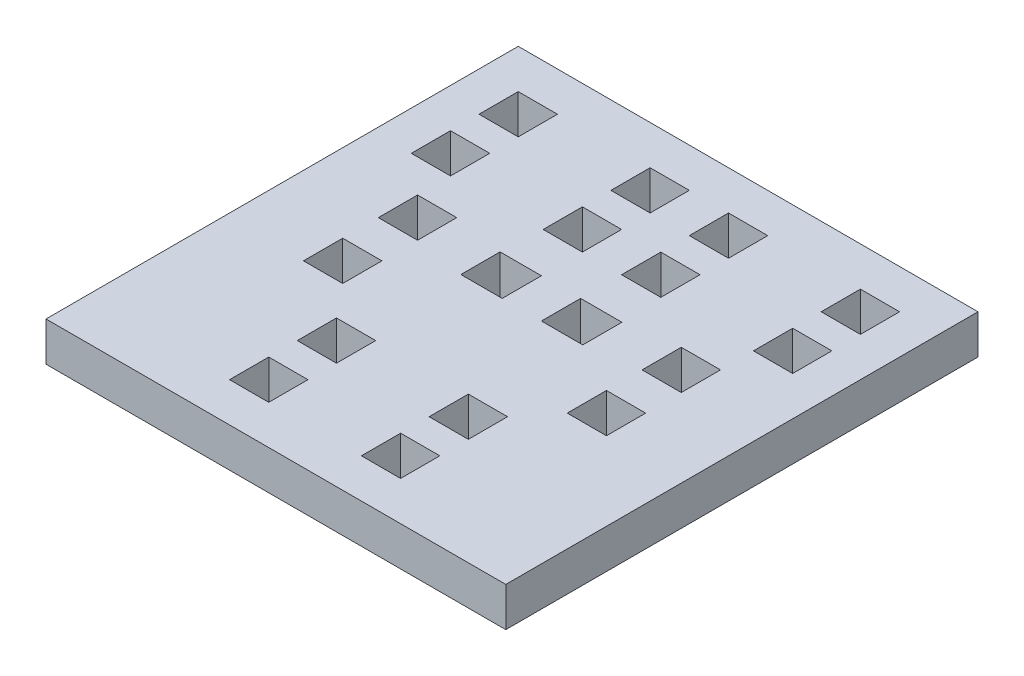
ISO-10303-21;
HEADER;
FILE_DESCRIPTION(('STEP AP214'),'2;1');
FILE_NAME('part.step','',(''),(''),'','','');
FILE_SCHEMA(('AUTOMOTIVE_DESIGN { 1 0 10303 214 1 1 1 1 }'));
ENDSEC;
DATA;
#1=APPLICATION_CONTEXT('core data for automotive mechanical design processes');
#2=APPLICATION_PROTOCOL_DEFINITION('international standard','automotive_design',2000,#1);
#3=PRODUCT_CONTEXT('',#1,'mechanical');
#4=PRODUCT('Part','Part','',(#3));
#5=PRODUCT_RELATED_PRODUCT_CATEGORY('part','',(#4));
#6=PRODUCT_DEFINITION_FORMATION('','',#4);
#7=PRODUCT_DEFINITION_CONTEXT('part definition',#1,'design');
#8=PRODUCT_DEFINITION('design','',#6,#7);
#9=PRODUCT_DEFINITION_SHAPE('','',#8);
#10=(LENGTH_UNIT() NAMED_UNIT(*) SI_UNIT(.MILLI.,.METRE.));
#11=(NAMED_UNIT(*) PLANE_ANGLE_UNIT() SI_UNIT($,.RADIAN.));
#12=(NAMED_UNIT(*) SI_UNIT($,.STERADIAN.) SOLID_ANGLE_UNIT());
#13=UNCERTAINTY_MEASURE_WITH_UNIT(LENGTH_MEASURE(1.E-05),#10,'distance_accuracy_value','');
#14=(GEOMETRIC_REPRESENTATION_CONTEXT(3) GLOBAL_UNCERTAINTY_ASSIGNED_CONTEXT((#13)) GLOBAL_UNIT_ASSIGNED_CONTEXT((#10,
#11,#12)) REPRESENTATION_CONTEXT('',''));
#15=CARTESIAN_POINT('',(0.,0.,0.));
#16=DIRECTION('',(0.,0.,1.));
#17=DIRECTION('',(1.,0.,0.));
#18=AXIS2_PLACEMENT_3D('',#15,#16,#17);
#19=CARTESIAN_POINT('',(0.,5.5,0.));
#20=DIRECTION('',(0.,-1.,0.));
#21=DIRECTION('',(0.,0.,-1.));
#22=AXIS2_PLACEMENT_3D('',#19,#20,#21);
#23=PLANE('',#22);
#24=DIRECTION('',(1.,0.,0.));
#25=VECTOR('',#24,1.);
#26=CARTESIAN_POINT('',(-20.25,5.5,-5.5));
#27=LINE('',#26,#25);
#28=CARTESIAN_POINT('',(-25.75,5.5,-5.5));
#29=VERTEX_POINT('',#28);
#30=CARTESIAN_POINT('',(-20.25,5.5,-5.5));
#31=VERTEX_POINT('',#30);
#32=EDGE_CURVE('E545',#29,#31,#27,.T.);
#33=ORIENTED_EDGE('',*,*,#32,.F.);
#34=DIRECTION('',(0.,0.,1.));
#35=VECTOR('',#34,1.);
#36=CARTESIAN_POINT('',(-25.75,5.5,-5.5));
#37=LINE('',#36,#35);
#38=CARTESIAN_POINT('',(-25.75,5.5,-11.));
#39=VERTEX_POINT('',#38);
#40=EDGE_CURVE('E553',#39,#29,#37,.T.);
#41=ORIENTED_EDGE('',*,*,#40,.F.);
#42=DIRECTION('',(-1.,0.,0.));
#43=VECTOR('',#42,1.);
#44=CARTESIAN_POINT('',(-25.75,5.5,-11.));
#45=LINE('',#44,#43);
#46=CARTESIAN_POINT('',(-20.25,5.5,-11.));
#47=VERTEX_POINT('',#46);
#48=EDGE_CURVE('E550',#47,#39,#45,.T.);
#49=ORIENTED_EDGE('',*,*,#48,.F.);
#50=DIRECTION('',(0.,0.,-1.));
#51=VECTOR('',#50,1.);
#52=CARTESIAN_POINT('',(-20.25,5.5,-11.));
#53=LINE('',#52,#51);
#54=EDGE_CURVE('E547',#31,#47,#53,.T.);
#55=ORIENTED_EDGE('',*,*,#54,.F.);
#56=EDGE_LOOP('',(#33,#41,#49,#55));
#57=FACE_BOUND('',#56,.T.);
#58=DIRECTION('',(0.,0.,1.));
#59=VECTOR('',#58,1.);
#60=CARTESIAN_POINT('',(-44.25,5.5,-5.5));
#61=LINE('',#60,#59);
#62=CARTESIAN_POINT('',(-44.25,5.5,-11.));
#63=VERTEX_POINT('',#62);
#64=CARTESIAN_POINT('',(-44.25,5.5,-5.5));
#65=VERTEX_POINT('',#64);
#66=EDGE_CURVE('E607',#63,#65,#61,.T.);
#67=ORIENTED_EDGE('',*,*,#66,.F.);
#68=DIRECTION('',(-1.,0.,0.));
#69=VECTOR('',#68,1.);
#70=CARTESIAN_POINT('',(-44.25,5.5,-11.));
#71=LINE('',#70,#69);
#72=CARTESIAN_POINT('',(-38.75,5.5,-11.));
#73=VERTEX_POINT('',#72);
#74=EDGE_CURVE('E615',#73,#63,#71,.T.);
#75=ORIENTED_EDGE('',*,*,#74,.F.);
#76=DIRECTION('',(0.,0.,-1.));
#77=VECTOR('',#76,1.);
#78=CARTESIAN_POINT('',(-38.75,5.5,-11.));
#79=LINE('',#78,#77);
#80=CARTESIAN_POINT('',(-38.75,5.5,-5.5));
#81=VERTEX_POINT('',#80);
#82=EDGE_CURVE('E612',#81,#73,#79,.T.);
#83=ORIENTED_EDGE('',*,*,#82,.F.);
#84=DIRECTION('',(1.,0.,0.));
#85=VECTOR('',#84,1.);
#86=CARTESIAN_POINT('',(-38.75,5.5,-5.5));
#87=LINE('',#86,#85);
#88=EDGE_CURVE('E609',#65,#81,#87,.T.);
#89=ORIENTED_EDGE('',*,*,#88,.F.);
#90=EDGE_LOOP('',(#67,#75,#83,#89));
#91=FACE_BOUND('',#90,.T.);
#92=DIRECTION('',(0.,0.,1.));
#93=VECTOR('',#92,1.);
#94=CARTESIAN_POINT('',(-29.5,5.5,-55.25));
#95=LINE('',#94,#93);
#96=CARTESIAN_POINT('',(-29.5,5.5,-60.75));
#97=VERTEX_POINT('',#96);
#98=CARTESIAN_POINT('',(-29.5,5.5,-55.25));
#99=VERTEX_POINT('',#98);
#100=EDGE_CURVE('E669',#97,#99,#95,.T.);
#101=ORIENTED_EDGE('',*,*,#100,.F.);
#102=DIRECTION('',(-1.,0.,0.));
#103=VECTOR('',#102,1.);
#104=CARTESIAN_POINT('',(-29.5,5.5,-60.75));
#105=LINE('',#104,#103);
#106=CARTESIAN_POINT('',(-24.,5.5,-60.75));
#107=VERTEX_POINT('',#106);
#108=EDGE_CURVE('E677',#107,#97,#105,.T.);
#109=ORIENTED_EDGE('',*,*,#108,.F.);
#110=DIRECTION('',(0.,0.,-1.));
#111=VECTOR('',#110,1.);
#112=CARTESIAN_POINT('',(-24.,5.5,-60.75));
#113=LINE('',#112,#111);
#114=CARTESIAN_POINT('',(-24.,5.5,-55.25));
#115=VERTEX_POINT('',#114);
#116=EDGE_CURVE('E674',#115,#107,#113,.T.);
#117=ORIENTED_EDGE('',*,*,#116,.F.);
#118=DIRECTION('',(1.,0.,0.));
#119=VECTOR('',#118,1.);
#120=CARTESIAN_POINT('',(-24.,5.5,-55.25));
#121=LINE('',#120,#119);
#122=EDGE_CURVE('E671',#99,#115,#121,.T.);
#123=ORIENTED_EDGE('',*,*,#122,.F.);
#124=EDGE_LOOP('',(#101,#109,#117,#123));
#125=FACE_BOUND('',#124,.T.);
#126=DIRECTION('',(1.,0.,0.));
#127=VECTOR('',#126,1.);
#128=CARTESIAN_POINT('',(-35.,5.5,-45.75));
#129=LINE('',#128,#127);
#130=CARTESIAN_POINT('',(-40.5,5.5,-45.75));
#131=VERTEX_POINT('',#130);
#132=CARTESIAN_POINT('',(-35.,5.5,-45.75));
#133=VERTEX_POINT('',#132);
#134=EDGE_CURVE('E731',#131,#133,#129,.T.);
#135=ORIENTED_EDGE('',*,*,#134,.F.);
#136=DIRECTION('',(0.,0.,1.));
#137=VECTOR('',#136,1.);
#138=CARTESIAN_POINT('',(-40.5,5.5,-45.75));
#139=LINE('',#138,#137);
#140=CARTESIAN_POINT('',(-40.5,5.5,-51.25));
#141=VERTEX_POINT('',#140);
#142=EDGE_CURVE('E739',#141,#131,#139,.T.);
#143=ORIENTED_EDGE('',*,*,#142,.F.);
#144=DIRECTION('',(-1.,0.,0.));
#145=VECTOR('',#144,1.);
#146=CARTESIAN_POINT('',(-40.5,5.5,-51.25));
#147=LINE('',#146,#145);
#148=CARTESIAN_POINT('',(-35.,5.5,-51.25));
#149=VERTEX_POINT('',#148);
#150=EDGE_CURVE('E736',#149,#141,#147,.T.);
#151=ORIENTED_EDGE('',*,*,#150,.F.);
#152=DIRECTION('',(0.,0.,-1.));
#153=VECTOR('',#152,1.);
#154=CARTESIAN_POINT('',(-35.,5.5,-51.25));
#155=LINE('',#154,#153);
#156=EDGE_CURVE('E733',#133,#149,#155,.T.);
#157=ORIENTED_EDGE('',*,*,#156,.F.);
#158=EDGE_LOOP('',(#135,#143,#151,#157));
#159=FACE_BOUND('',#158,.T.);
#160=DIRECTION('',(0.,0.,-1.));
#161=VECTOR('',#160,1.);
#162=CARTESIAN_POINT('',(-5.5,5.5,-60.75));
#163=LINE('',#162,#161);
#164=CARTESIAN_POINT('',(-5.5,5.5,-55.25));
#165=VERTEX_POINT('',#164);
#166=CARTESIAN_POINT('',(-5.5,5.5,-60.75));
#167=VERTEX_POINT('',#166);
#168=EDGE_CURVE('E793',#165,#167,#163,.T.);
#169=ORIENTED_EDGE('',*,*,#168,.F.);
#170=DIRECTION('',(1.,0.,0.));
#171=VECTOR('',#170,1.);
#172=CARTESIAN_POINT('',(-5.5,5.5,-55.25));
#173=LINE('',#172,#171);
#174=CARTESIAN_POINT('',(-11.,5.5,-55.25));
#175=VERTEX_POINT('',#174);
#176=EDGE_CURVE('E801',#175,#165,#173,.T.);
#177=ORIENTED_EDGE('',*,*,#176,.F.);
#178=DIRECTION('',(0.,0.,1.));
#179=VECTOR('',#178,1.);
#180=CARTESIAN_POINT('',(-11.,5.5,-55.25));
#181=LINE('',#180,#179);
#182=CARTESIAN_POINT('',(-11.,5.5,-60.75));
#183=VERTEX_POINT('',#182);
#184=EDGE_CURVE('E798',#183,#175,#181,.T.);
#185=ORIENTED_EDGE('',*,*,#184,.F.);
#186=DIRECTION('',(-1.,0.,0.));
#187=VECTOR('',#186,1.);
#188=CARTESIAN_POINT('',(-11.,5.5,-60.75));
#189=LINE('',#188,#187);
#190=EDGE_CURVE('E795',#167,#183,#189,.T.);
#191=ORIENTED_EDGE('',*,*,#190,.F.);
#192=EDGE_LOOP('',(#169,#177,#185,#191));
#193=FACE_BOUND('',#192,.T.);
#194=DIRECTION('',(0.,0.,1.));
#195=VECTOR('',#194,1.);
#196=CARTESIAN_POINT('',(-59.,5.5,-55.25));
#197=LINE('',#196,#195);
#198=CARTESIAN_POINT('',(-59.,5.5,-60.75));
#199=VERTEX_POINT('',#198);
#200=CARTESIAN_POINT('',(-59.,5.5,-55.25));
#201=VERTEX_POINT('',#200);
#202=EDGE_CURVE('E855',#199,#201,#197,.T.);
#203=ORIENTED_EDGE('',*,*,#202,.F.);
#204=DIRECTION('',(-1.,0.,0.));
#205=VECTOR('',#204,1.);
#206=CARTESIAN_POINT('',(-59.,5.5,-60.75));
#207=LINE('',#206,#205);
#208=CARTESIAN_POINT('',(-53.5,5.5,-60.75));
#209=VERTEX_POINT('',#208);
#210=EDGE_CURVE('E863',#209,#199,#207,.T.);
#211=ORIENTED_EDGE('',*,*,#210,.F.);
#212=DIRECTION('',(0.,0.,-1.));
#213=VECTOR('',#212,1.);
#214=CARTESIAN_POINT('',(-53.5,5.5,-60.75));
#215=LINE('',#214,#213);
#216=CARTESIAN_POINT('',(-53.5,5.5,-55.25));
#217=VERTEX_POINT('',#216);
#218=EDGE_CURVE('E860',#217,#209,#215,.T.);
#219=ORIENTED_EDGE('',*,*,#218,.F.);
#220=DIRECTION('',(1.,0.,0.));
#221=VECTOR('',#220,1.);
#222=CARTESIAN_POINT('',(-53.5,5.5,-55.25));
#223=LINE('',#222,#221);
#224=EDGE_CURVE('E857',#201,#217,#223,.T.);
#225=ORIENTED_EDGE('',*,*,#224,.F.);
#226=EDGE_LOOP('',(#203,#211,#219,#225));
#227=FACE_BOUND('',#226,.T.);
#228=DIRECTION('',(0.,0.,-1.));
#229=VECTOR('',#228,1.);
#230=CARTESIAN_POINT('',(-11.,5.5,-41.125));
#231=LINE('',#230,#229);
#232=CARTESIAN_POINT('',(-11.,5.5,-35.625));
#233=VERTEX_POINT('',#232);
#234=CARTESIAN_POINT('',(-11.,5.5,-41.125));
#235=VERTEX_POINT('',#234);
#236=EDGE_CURVE('E917',#233,#235,#231,.T.);
#237=ORIENTED_EDGE('',*,*,#236,.F.);
#238=DIRECTION('',(1.,0.,0.));
#239=VECTOR('',#238,1.);
#240=CARTESIAN_POINT('',(-11.,5.5,-35.625));
#241=LINE('',#240,#239);
#242=CARTESIAN_POINT('',(-16.5,5.5,-35.625));
#243=VERTEX_POINT('',#242);
#244=EDGE_CURVE('E925',#243,#233,#241,.T.);
#245=ORIENTED_EDGE('',*,*,#244,.F.);
#246=DIRECTION('',(0.,0.,1.));
#247=VECTOR('',#246,1.);
#248=CARTESIAN_POINT('',(-16.5,5.5,-35.625));
#249=LINE('',#248,#247);
#250=CARTESIAN_POINT('',(-16.5,5.5,-41.125));
#251=VERTEX_POINT('',#250);
#252=EDGE_CURVE('E922',#251,#243,#249,.T.);
#253=ORIENTED_EDGE('',*,*,#252,.F.);
#254=DIRECTION('',(-1.,0.,0.));
#255=VECTOR('',#254,1.);
#256=CARTESIAN_POINT('',(-16.5,5.5,-41.125));
#257=LINE('',#256,#255);
#258=EDGE_CURVE('E919',#235,#251,#257,.T.);
#259=ORIENTED_EDGE('',*,*,#258,.F.);
#260=EDGE_LOOP('',(#237,#245,#253,#259));
#261=FACE_BOUND('',#260,.T.);
#262=DIRECTION('',(0.,0.,1.));
#263=VECTOR('',#262,1.);
#264=CARTESIAN_POINT('',(-53.5,5.5,-35.625));
#265=LINE('',#264,#263);
#266=CARTESIAN_POINT('',(-53.5,5.5,-41.125));
#267=VERTEX_POINT('',#266);
#268=CARTESIAN_POINT('',(-53.5,5.5,-35.625));
#269=VERTEX_POINT('',#268);
#270=EDGE_CURVE('E979',#267,#269,#265,.T.);
#271=ORIENTED_EDGE('',*,*,#270,.F.);
#272=DIRECTION('',(-1.,0.,0.));
#273=VECTOR('',#272,1.);
#274=CARTESIAN_POINT('',(-53.5,5.5,-41.125));
#275=LINE('',#274,#273);
#276=CARTESIAN_POINT('',(-48.,5.5,-41.125));
#277=VERTEX_POINT('',#276);
#278=EDGE_CURVE('E987',#277,#267,#275,.T.);
#279=ORIENTED_EDGE('',*,*,#278,.F.);
#280=DIRECTION('',(0.,0.,-1.));
#281=VECTOR('',#280,1.);
#282=CARTESIAN_POINT('',(-48.,5.5,-41.125));
#283=LINE('',#282,#281);
#284=CARTESIAN_POINT('',(-48.,5.5,-35.625));
#285=VERTEX_POINT('',#284);
#286=EDGE_CURVE('E984',#285,#277,#283,.T.);
#287=ORIENTED_EDGE('',*,*,#286,.F.);
#288=DIRECTION('',(1.,0.,0.));
#289=VECTOR('',#288,1.);
#290=CARTESIAN_POINT('',(-48.,5.5,-35.625));
#291=LINE('',#290,#289);
#292=EDGE_CURVE('E981',#269,#285,#291,.T.);
#293=ORIENTED_EDGE('',*,*,#292,.F.);
#294=EDGE_LOOP('',(#271,#279,#287,#293));
#295=FACE_BOUND('',#294,.T.);
#296=DIRECTION('',(0.,0.,1.));
#297=VECTOR('',#296,1.);
#298=CARTESIAN_POINT('',(-40.8,5.5,-34.5));
#299=LINE('',#298,#297);
#300=CARTESIAN_POINT('',(-40.8,5.5,-40.));
#301=VERTEX_POINT('',#300);
#302=CARTESIAN_POINT('',(-40.8,5.5,-34.5));
#303=VERTEX_POINT('',#302);
#304=EDGE_CURVE('E1041',#301,#303,#299,.T.);
#305=ORIENTED_EDGE('',*,*,#304,.F.);
#306=DIRECTION('',(-1.,0.,0.));
#307=VECTOR('',#306,1.);
#308=CARTESIAN_POINT('',(-40.8,5.5,-40.));
#309=LINE('',#308,#307);
#310=CARTESIAN_POINT('',(-35.,5.5,-40.));
#311=VERTEX_POINT('',#310);
#312=EDGE_CURVE('E1049',#311,#301,#309,.T.);
#313=ORIENTED_EDGE('',*,*,#312,.F.);
#314=DIRECTION('',(0.,0.,-1.));
#315=VECTOR('',#314,1.);
#316=CARTESIAN_POINT('',(-35.,5.5,-40.));
#317=LINE('',#316,#315);
#318=CARTESIAN_POINT('',(-35.,5.5,-34.5));
#319=VERTEX_POINT('',#318);
#320=EDGE_CURVE('E1046',#319,#311,#317,.T.);
#321=ORIENTED_EDGE('',*,*,#320,.F.);
#322=DIRECTION('',(1.,0.,0.));
#323=VECTOR('',#322,1.);
#324=CARTESIAN_POINT('',(-35.,5.5,-34.5));
#325=LINE('',#324,#323);
#326=EDGE_CURVE('E1043',#303,#319,#325,.T.);
#327=ORIENTED_EDGE('',*,*,#326,.F.);
#328=EDGE_LOOP('',(#305,#313,#321,#327));
#329=FACE_BOUND('',#328,.T.);
#330=DIRECTION('',(1.,0.,0.));
#331=VECTOR('',#330,1.);
#332=CARTESIAN_POINT('',(0.,5.5,0.));
#333=LINE('',#332,#331);
#334=CARTESIAN_POINT('',(-64.5,5.5,0.));
#335=VERTEX_POINT('',#334);
#336=CARTESIAN_POINT('',(0.,5.5,0.));
#337=VERTEX_POINT('',#336);
#338=EDGE_CURVE('E1072',#335,#337,#333,.T.);
#339=ORIENTED_EDGE('',*,*,#338,.T.);
#340=DIRECTION('',(0.,0.,-1.));
#341=VECTOR('',#340,1.);
#342=CARTESIAN_POINT('',(0.,5.5,-66.25));
#343=LINE('',#342,#341);
#344=CARTESIAN_POINT('',(0.,5.5,-66.25));
#345=VERTEX_POINT('',#344);
#346=EDGE_CURVE('E1075',#337,#345,#343,.T.);
#347=ORIENTED_EDGE('',*,*,#346,.T.);
#348=DIRECTION('',(-1.,0.,0.));
#349=VECTOR('',#348,1.);
#350=CARTESIAN_POINT('',(-64.5,5.5,-66.25));
#351=LINE('',#350,#349);
#352=CARTESIAN_POINT('',(-64.5,5.5,-66.25));
#353=VERTEX_POINT('',#352);
#354=EDGE_CURVE('E1078',#345,#353,#351,.T.);
#355=ORIENTED_EDGE('',*,*,#354,.T.);
#356=DIRECTION('',(0.,0.,1.));
#357=VECTOR('',#356,1.);
#358=CARTESIAN_POINT('',(-64.5,5.5,0.));
#359=LINE('',#358,#357);
#360=EDGE_CURVE('E1080',#353,#335,#359,.T.);
#361=ORIENTED_EDGE('',*,*,#360,.T.);
#362=EDGE_LOOP('',(#339,#347,#355,#361));
#363=FACE_BOUND('',#362,.T.);
#364=DIRECTION('',(0.,0.,-1.));
#365=VECTOR('',#364,1.);
#366=CARTESIAN_POINT('',(-23.7,5.5,-40.));
#367=LINE('',#366,#365);
#368=CARTESIAN_POINT('',(-23.7,5.5,-34.5));
#369=VERTEX_POINT('',#368);
#370=CARTESIAN_POINT('',(-23.7,5.5,-40.));
#371=VERTEX_POINT('',#370);
#372=EDGE_CURVE('E1010',#369,#371,#367,.T.);
#373=ORIENTED_EDGE('',*,*,#372,.F.);
#374=DIRECTION('',(1.,0.,0.));
#375=VECTOR('',#374,1.);
#376=CARTESIAN_POINT('',(-23.7,5.5,-34.5));
#377=LINE('',#376,#375);
#378=CARTESIAN_POINT('',(-29.5,5.5,-34.5));
#379=VERTEX_POINT('',#378);
#380=EDGE_CURVE('E1018',#379,#369,#377,.T.);
#381=ORIENTED_EDGE('',*,*,#380,.F.);
#382=DIRECTION('',(0.,0.,1.));
#383=VECTOR('',#382,1.);
#384=CARTESIAN_POINT('',(-29.5,5.5,-34.5));
#385=LINE('',#384,#383);
#386=CARTESIAN_POINT('',(-29.5,5.5,-40.));
#387=VERTEX_POINT('',#386);
#388=EDGE_CURVE('E1015',#387,#379,#385,.T.);
#389=ORIENTED_EDGE('',*,*,#388,.F.);
#390=DIRECTION('',(-1.,0.,0.));
#391=VECTOR('',#390,1.);
#392=CARTESIAN_POINT('',(-29.5,5.5,-40.));
#393=LINE('',#392,#391);
#394=EDGE_CURVE('E1012',#371,#387,#393,.T.);
#395=ORIENTED_EDGE('',*,*,#394,.F.);
#396=EDGE_LOOP('',(#373,#381,#389,#395));
#397=FACE_BOUND('',#396,.T.);
#398=DIRECTION('',(0.,0.,1.));
#399=VECTOR('',#398,1.);
#400=CARTESIAN_POINT('',(-53.5,5.5,-25.125));
#401=LINE('',#400,#399);
#402=CARTESIAN_POINT('',(-53.5,5.5,-30.625));
#403=VERTEX_POINT('',#402);
#404=CARTESIAN_POINT('',(-53.5,5.5,-25.125));
#405=VERTEX_POINT('',#404);
#406=EDGE_CURVE('E948',#403,#405,#401,.T.);
#407=ORIENTED_EDGE('',*,*,#406,.F.);
#408=DIRECTION('',(-1.,0.,0.));
#409=VECTOR('',#408,1.);
#410=CARTESIAN_POINT('',(-53.5,5.5,-30.625));
#411=LINE('',#410,#409);
#412=CARTESIAN_POINT('',(-48.,5.5,-30.625));
#413=VERTEX_POINT('',#412);
#414=EDGE_CURVE('E956',#413,#403,#411,.T.);
#415=ORIENTED_EDGE('',*,*,#414,.F.);
#416=DIRECTION('',(0.,0.,-1.));
#417=VECTOR('',#416,1.);
#418=CARTESIAN_POINT('',(-48.,5.5,-30.625));
#419=LINE('',#418,#417);
#420=CARTESIAN_POINT('',(-48.,5.5,-25.125));
#421=VERTEX_POINT('',#420);
#422=EDGE_CURVE('E953',#421,#413,#419,.T.);
#423=ORIENTED_EDGE('',*,*,#422,.F.);
#424=DIRECTION('',(1.,0.,0.));
#425=VECTOR('',#424,1.);
#426=CARTESIAN_POINT('',(-48.,5.5,-25.125));
#427=LINE('',#426,#425);
#428=EDGE_CURVE('E950',#405,#421,#427,.T.);
#429=ORIENTED_EDGE('',*,*,#428,.F.);
#430=EDGE_LOOP('',(#407,#415,#423,#429));
#431=FACE_BOUND('',#430,.T.);
#432=DIRECTION('',(1.,0.,0.));
#433=VECTOR('',#432,1.);
#434=CARTESIAN_POINT('',(-11.,5.5,-25.125));
#435=LINE('',#434,#433);
#436=CARTESIAN_POINT('',(-16.5,5.5,-25.125));
#437=VERTEX_POINT('',#436);
#438=CARTESIAN_POINT('',(-11.,5.5,-25.125));
#439=VERTEX_POINT('',#438);
#440=EDGE_CURVE('E886',#437,#439,#435,.T.);
#441=ORIENTED_EDGE('',*,*,#440,.F.);
#442=DIRECTION('',(0.,0.,1.));
#443=VECTOR('',#442,1.);
#444=CARTESIAN_POINT('',(-16.5,5.5,-25.125));
#445=LINE('',#444,#443);
#446=CARTESIAN_POINT('',(-16.5,5.5,-30.625));
#447=VERTEX_POINT('',#446);
#448=EDGE_CURVE('E894',#447,#437,#445,.T.);
#449=ORIENTED_EDGE('',*,*,#448,.F.);
#450=DIRECTION('',(-1.,0.,0.));
#451=VECTOR('',#450,1.);
#452=CARTESIAN_POINT('',(-16.5,5.5,-30.625));
#453=LINE('',#452,#451);
#454=CARTESIAN_POINT('',(-11.,5.5,-30.625));
#455=VERTEX_POINT('',#454);
#456=EDGE_CURVE('E891',#455,#447,#453,.T.);
#457=ORIENTED_EDGE('',*,*,#456,.F.);
#458=DIRECTION('',(0.,0.,-1.));
#459=VECTOR('',#458,1.);
#460=CARTESIAN_POINT('',(-11.,5.5,-30.625));
#461=LINE('',#460,#459);
#462=EDGE_CURVE('E888',#439,#455,#461,.T.);
#463=ORIENTED_EDGE('',*,*,#462,.F.);
#464=EDGE_LOOP('',(#441,#449,#457,#463));
#465=FACE_BOUND('',#464,.T.);
#466=DIRECTION('',(1.,0.,0.));
#467=VECTOR('',#466,1.);
#468=CARTESIAN_POINT('',(-53.5,5.5,-45.75));
#469=LINE('',#468,#467);
#470=CARTESIAN_POINT('',(-59.,5.5,-45.75));
#471=VERTEX_POINT('',#470);
#472=CARTESIAN_POINT('',(-53.5,5.5,-45.75));
#473=VERTEX_POINT('',#472);
#474=EDGE_CURVE('E824',#471,#473,#469,.T.);
#475=ORIENTED_EDGE('',*,*,#474,.F.);
#476=DIRECTION('',(0.,0.,1.));
#477=VECTOR('',#476,1.);
#478=CARTESIAN_POINT('',(-59.,5.5,-45.75));
#479=LINE('',#478,#477);
#480=CARTESIAN_POINT('',(-59.,5.5,-51.25));
#481=VERTEX_POINT('',#480);
#482=EDGE_CURVE('E832',#481,#471,#479,.T.);
#483=ORIENTED_EDGE('',*,*,#482,.F.);
#484=DIRECTION('',(-1.,0.,0.));
#485=VECTOR('',#484,1.);
#486=CARTESIAN_POINT('',(-59.,5.5,-51.25));
#487=LINE('',#486,#485);
#488=CARTESIAN_POINT('',(-53.5,5.5,-51.25));
#489=VERTEX_POINT('',#488);
#490=EDGE_CURVE('E829',#489,#481,#487,.T.);
#491=ORIENTED_EDGE('',*,*,#490,.F.);
#492=DIRECTION('',(0.,0.,-1.));
#493=VECTOR('',#492,1.);
#494=CARTESIAN_POINT('',(-53.5,5.5,-51.25));
#495=LINE('',#494,#493);
#496=EDGE_CURVE('E826',#473,#489,#495,.T.);
#497=ORIENTED_EDGE('',*,*,#496,.F.);
#498=EDGE_LOOP('',(#475,#483,#491,#497));
#499=FACE_BOUND('',#498,.T.);
#500=DIRECTION('',(0.,0.,1.));
#501=VECTOR('',#500,1.);
#502=CARTESIAN_POINT('',(-11.,5.5,-45.75));
#503=LINE('',#502,#501);
#504=CARTESIAN_POINT('',(-11.,5.5,-51.25));
#505=VERTEX_POINT('',#504);
#506=CARTESIAN_POINT('',(-11.,5.5,-45.75));
#507=VERTEX_POINT('',#506);
#508=EDGE_CURVE('E762',#505,#507,#503,.T.);
#509=ORIENTED_EDGE('',*,*,#508,.F.);
#510=DIRECTION('',(-1.,0.,0.));
#511=VECTOR('',#510,1.);
#512=CARTESIAN_POINT('',(-11.,5.5,-51.25));
#513=LINE('',#512,#511);
#514=CARTESIAN_POINT('',(-5.5,5.5,-51.25));
#515=VERTEX_POINT('',#514);
#516=EDGE_CURVE('E770',#515,#505,#513,.T.);
#517=ORIENTED_EDGE('',*,*,#516,.F.);
#518=DIRECTION('',(0.,0.,-1.));
#519=VECTOR('',#518,1.);
#520=CARTESIAN_POINT('',(-5.5,5.5,-51.25));
#521=LINE('',#520,#519);
#522=CARTESIAN_POINT('',(-5.5,5.5,-45.75));
#523=VERTEX_POINT('',#522);
#524=EDGE_CURVE('E767',#523,#515,#521,.T.);
#525=ORIENTED_EDGE('',*,*,#524,.F.);
#526=DIRECTION('',(1.,0.,0.));
#527=VECTOR('',#526,1.);
#528=CARTESIAN_POINT('',(-5.5,5.5,-45.75));
#529=LINE('',#528,#527);
#530=EDGE_CURVE('E764',#507,#523,#529,.T.);
#531=ORIENTED_EDGE('',*,*,#530,.F.);
#532=EDGE_LOOP('',(#509,#517,#525,#531));
#533=FACE_BOUND('',#532,.T.);
#534=DIRECTION('',(0.,0.,1.));
#535=VECTOR('',#534,1.);
#536=CARTESIAN_POINT('',(-40.5,5.5,-55.25));
#537=LINE('',#536,#535);
#538=CARTESIAN_POINT('',(-40.5,5.5,-60.75));
#539=VERTEX_POINT('',#538);
#540=CARTESIAN_POINT('',(-40.5,5.5,-55.25));
#541=VERTEX_POINT('',#540);
#542=EDGE_CURVE('E700',#539,#541,#537,.T.);
#543=ORIENTED_EDGE('',*,*,#542,.F.);
#544=DIRECTION('',(-1.,0.,0.));
#545=VECTOR('',#544,1.);
#546=CARTESIAN_POINT('',(-40.5,5.5,-60.75));
#547=LINE('',#546,#545);
#548=CARTESIAN_POINT('',(-35.,5.5,-60.75));
#549=VERTEX_POINT('',#548);
#550=EDGE_CURVE('E708',#549,#539,#547,.T.);
#551=ORIENTED_EDGE('',*,*,#550,.F.);
#552=DIRECTION('',(0.,0.,-1.));
#553=VECTOR('',#552,1.);
#554=CARTESIAN_POINT('',(-35.,5.5,-60.75));
#555=LINE('',#554,#553);
#556=CARTESIAN_POINT('',(-35.,5.5,-55.25));
#557=VERTEX_POINT('',#556);
#558=EDGE_CURVE('E705',#557,#549,#555,.T.);
#559=ORIENTED_EDGE('',*,*,#558,.F.);
#560=DIRECTION('',(1.,0.,0.));
#561=VECTOR('',#560,1.);
#562=CARTESIAN_POINT('',(-35.,5.5,-55.25));
#563=LINE('',#562,#561);
#564=EDGE_CURVE('E702',#541,#557,#563,.T.);
#565=ORIENTED_EDGE('',*,*,#564,.F.);
#566=EDGE_LOOP('',(#543,#551,#559,#565));
#567=FACE_BOUND('',#566,.T.);
#568=DIRECTION('',(0.,0.,1.));
#569=VECTOR('',#568,1.);
#570=CARTESIAN_POINT('',(-29.5,5.5,-45.75));
#571=LINE('',#570,#569);
#572=CARTESIAN_POINT('',(-29.5,5.5,-51.25));
#573=VERTEX_POINT('',#572);
#574=CARTESIAN_POINT('',(-29.5,5.5,-45.75));
#575=VERTEX_POINT('',#574);
#576=EDGE_CURVE('E638',#573,#575,#571,.T.);
#577=ORIENTED_EDGE('',*,*,#576,.F.);
#578=DIRECTION('',(-1.,0.,0.));
#579=VECTOR('',#578,1.);
#580=CARTESIAN_POINT('',(-29.5,5.5,-51.25));
#581=LINE('',#580,#579);
#582=CARTESIAN_POINT('',(-24.,5.5,-51.25));
#583=VERTEX_POINT('',#582);
#584=EDGE_CURVE('E646',#583,#573,#581,.T.);
#585=ORIENTED_EDGE('',*,*,#584,.F.);
#586=DIRECTION('',(0.,0.,-1.));
#587=VECTOR('',#586,1.);
#588=CARTESIAN_POINT('',(-24.,5.5,-51.25));
#589=LINE('',#588,#587);
#590=CARTESIAN_POINT('',(-24.,5.5,-45.75));
#591=VERTEX_POINT('',#590);
#592=EDGE_CURVE('E643',#591,#583,#589,.T.);
#593=ORIENTED_EDGE('',*,*,#592,.F.);
#594=DIRECTION('',(1.,0.,0.));
#595=VECTOR('',#594,1.);
#596=CARTESIAN_POINT('',(-24.,5.5,-45.75));
#597=LINE('',#596,#595);
#598=EDGE_CURVE('E640',#575,#591,#597,.T.);
#599=ORIENTED_EDGE('',*,*,#598,.F.);
#600=EDGE_LOOP('',(#577,#585,#593,#599));
#601=FACE_BOUND('',#600,.T.);
#602=DIRECTION('',(0.,0.,1.));
#603=VECTOR('',#602,1.);
#604=CARTESIAN_POINT('',(-44.25,5.5,-15.));
#605=LINE('',#604,#603);
#606=CARTESIAN_POINT('',(-44.25,5.5,-20.5));
#607=VERTEX_POINT('',#606);
#608=CARTESIAN_POINT('',(-44.25,5.5,-15.));
#609=VERTEX_POINT('',#608);
#610=EDGE_CURVE('E576',#607,#609,#605,.T.);
#611=ORIENTED_EDGE('',*,*,#610,.F.);
#612=DIRECTION('',(-1.,0.,0.));
#613=VECTOR('',#612,1.);
#614=CARTESIAN_POINT('',(-44.25,5.5,-20.5));
#615=LINE('',#614,#613);
#616=CARTESIAN_POINT('',(-38.75,5.5,-20.5));
#617=VERTEX_POINT('',#616);
#618=EDGE_CURVE('E584',#617,#607,#615,.T.);
#619=ORIENTED_EDGE('',*,*,#618,.F.);
#620=DIRECTION('',(0.,0.,-1.));
#621=VECTOR('',#620,1.);
#622=CARTESIAN_POINT('',(-38.75,5.5,-20.5));
#623=LINE('',#622,#621);
#624=CARTESIAN_POINT('',(-38.75,5.5,-15.));
#625=VERTEX_POINT('',#624);
#626=EDGE_CURVE('E581',#625,#617,#623,.T.);
#627=ORIENTED_EDGE('',*,*,#626,.F.);
#628=DIRECTION('',(1.,0.,0.));
#629=VECTOR('',#628,1.);
#630=CARTESIAN_POINT('',(-38.75,5.5,-15.));
#631=LINE('',#630,#629);
#632=EDGE_CURVE('E578',#609,#625,#631,.T.);
#633=ORIENTED_EDGE('',*,*,#632,.F.);
#634=EDGE_LOOP('',(#611,#619,#627,#633));
#635=FACE_BOUND('',#634,.T.);
#636=DIRECTION('',(0.,0.,-1.));
#637=VECTOR('',#636,1.);
#638=CARTESIAN_POINT('',(-20.25,5.5,-20.5));
#639=LINE('',#638,#637);
#640=CARTESIAN_POINT('',(-20.25,5.5,-15.));
#641=VERTEX_POINT('',#640);
#642=CARTESIAN_POINT('',(-20.25,5.5,-20.5));
#643=VERTEX_POINT('',#642);
#644=EDGE_CURVE('E509',#641,#643,#639,.T.);
#645=ORIENTED_EDGE('',*,*,#644,.F.);
#646=DIRECTION('',(1.,0.,0.));
#647=VECTOR('',#646,1.);
#648=CARTESIAN_POINT('',(-20.25,5.5,-15.));
#649=LINE('',#648,#647);
#650=CARTESIAN_POINT('',(-25.75,5.5,-15.));
#651=VERTEX_POINT('',#650);
#652=EDGE_CURVE('E531',#651,#641,#649,.T.);
#653=ORIENTED_EDGE('',*,*,#652,.F.);
#654=DIRECTION('',(0.,0.,1.));
#655=VECTOR('',#654,1.);
#656=CARTESIAN_POINT('',(-25.75,5.5,-15.));
#657=LINE('',#656,#655);
#658=CARTESIAN_POINT('',(-25.75,5.5,-20.5));
#659=VERTEX_POINT('',#658);
#660=EDGE_CURVE('E529',#659,#651,#657,.T.);
#661=ORIENTED_EDGE('',*,*,#660,.F.);
#662=DIRECTION('',(-1.,0.,0.));
#663=VECTOR('',#662,1.);
#664=CARTESIAN_POINT('',(-25.75,5.5,-20.5));
#665=LINE('',#664,#663);
#666=EDGE_CURVE('E517',#643,#659,#665,.T.);
#667=ORIENTED_EDGE('',*,*,#666,.F.);
#668=EDGE_LOOP('',(#645,#653,#661,#667));
#669=FACE_BOUND('',#668,.T.);
#670=ADVANCED_FACE('F36',(#57,#91,#125,#159,#193,#227,#261,#295,#329,#363,#397,#431,#465,#499,
#533,#567,#601,#635,#669),#23,.F.);
#671=CARTESIAN_POINT('',(0.,0.,0.));
#672=DIRECTION('',(0.,-1.,0.));
#673=DIRECTION('',(0.,0.,-1.));
#674=AXIS2_PLACEMENT_3D('',#671,#672,#673);
#675=PLANE('',#674);
#676=DIRECTION('',(1.,0.,0.));
#677=VECTOR('',#676,1.);
#678=CARTESIAN_POINT('',(0.,0.,0.));
#679=LINE('',#678,#677);
#680=CARTESIAN_POINT('',(-64.5,0.,0.));
#681=VERTEX_POINT('',#680);
#682=CARTESIAN_POINT('',(0.,0.,0.));
#683=VERTEX_POINT('',#682);
#684=EDGE_CURVE('E1071',#681,#683,#679,.T.);
#685=ORIENTED_EDGE('',*,*,#684,.F.);
#686=DIRECTION('',(0.,0.,1.));
#687=VECTOR('',#686,1.);
#688=CARTESIAN_POINT('',(-64.5,0.,0.));
#689=LINE('',#688,#687);
#690=CARTESIAN_POINT('',(-64.5,0.,-66.25));
#691=VERTEX_POINT('',#690);
#692=EDGE_CURVE('E1076',#691,#681,#689,.T.);
#693=ORIENTED_EDGE('',*,*,#692,.F.);
#694=DIRECTION('',(-1.,0.,0.));
#695=VECTOR('',#694,1.);
#696=CARTESIAN_POINT('',(-64.5,0.,-66.25));
#697=LINE('',#696,#695);
#698=CARTESIAN_POINT('',(0.,0.,-66.25));
#699=VERTEX_POINT('',#698);
#700=EDGE_CURVE('E1087',#699,#691,#697,.T.);
#701=ORIENTED_EDGE('',*,*,#700,.F.);
#702=DIRECTION('',(0.,0.,-1.));
#703=VECTOR('',#702,1.);
#704=CARTESIAN_POINT('',(0.,0.,-66.25));
#705=LINE('',#704,#703);
#706=EDGE_CURVE('E1085',#683,#699,#705,.T.);
#707=ORIENTED_EDGE('',*,*,#706,.F.);
#708=EDGE_LOOP('',(#685,#693,#701,#707));
#709=FACE_BOUND('',#708,.T.);
#710=DIRECTION('',(-1.,0.,0.));
#711=VECTOR('',#710,1.);
#712=CARTESIAN_POINT('',(-40.8,0.,-40.));
#713=LINE('',#712,#711);
#714=CARTESIAN_POINT('',(-35.,0.,-40.));
#715=VERTEX_POINT('',#714);
#716=CARTESIAN_POINT('',(-40.8,0.,-40.));
#717=VERTEX_POINT('',#716);
#718=EDGE_CURVE('E1044',#715,#717,#713,.T.);
#719=ORIENTED_EDGE('',*,*,#718,.T.);
#720=DIRECTION('',(0.,0.,1.));
#721=VECTOR('',#720,1.);
#722=CARTESIAN_POINT('',(-40.8,0.,-34.5));
#723=LINE('',#722,#721);
#724=CARTESIAN_POINT('',(-40.8,0.,-34.5));
#725=VERTEX_POINT('',#724);
#726=EDGE_CURVE('E1040',#717,#725,#723,.T.);
#727=ORIENTED_EDGE('',*,*,#726,.T.);
#728=DIRECTION('',(1.,0.,0.));
#729=VECTOR('',#728,1.);
#730=CARTESIAN_POINT('',(-35.,0.,-34.5));
#731=LINE('',#730,#729);
#732=CARTESIAN_POINT('',(-35.,0.,-34.5));
#733=VERTEX_POINT('',#732);
#734=EDGE_CURVE('E1054',#725,#733,#731,.T.);
#735=ORIENTED_EDGE('',*,*,#734,.T.);
#736=DIRECTION('',(0.,0.,-1.));
#737=VECTOR('',#736,1.);
#738=CARTESIAN_POINT('',(-35.,0.,-40.));
#739=LINE('',#738,#737);
#740=EDGE_CURVE('E1057',#733,#715,#739,.T.);
#741=ORIENTED_EDGE('',*,*,#740,.T.);
#742=EDGE_LOOP('',(#719,#727,#735,#741));
#743=FACE_BOUND('',#742,.T.);
#744=DIRECTION('',(1.,0.,0.));
#745=VECTOR('',#744,1.);
#746=CARTESIAN_POINT('',(-23.7,0.,-34.5));
#747=LINE('',#746,#745);
#748=CARTESIAN_POINT('',(-29.5,0.,-34.5));
#749=VERTEX_POINT('',#748);
#750=CARTESIAN_POINT('',(-23.7,0.,-34.5));
#751=VERTEX_POINT('',#750);
#752=EDGE_CURVE('E1013',#749,#751,#747,.T.);
#753=ORIENTED_EDGE('',*,*,#752,.T.);
#754=DIRECTION('',(0.,0.,-1.));
#755=VECTOR('',#754,1.);
#756=CARTESIAN_POINT('',(-23.7,0.,-40.));
#757=LINE('',#756,#755);
#758=CARTESIAN_POINT('',(-23.7,0.,-40.));
#759=VERTEX_POINT('',#758);
#760=EDGE_CURVE('E1009',#751,#759,#757,.T.);
#761=ORIENTED_EDGE('',*,*,#760,.T.);
#762=DIRECTION('',(-1.,0.,0.));
#763=VECTOR('',#762,1.);
#764=CARTESIAN_POINT('',(-29.5,0.,-40.));
#765=LINE('',#764,#763);
#766=CARTESIAN_POINT('',(-29.5,0.,-40.));
#767=VERTEX_POINT('',#766);
#768=EDGE_CURVE('E1023',#759,#767,#765,.T.);
#769=ORIENTED_EDGE('',*,*,#768,.T.);
#770=DIRECTION('',(0.,0.,1.));
#771=VECTOR('',#770,1.);
#772=CARTESIAN_POINT('',(-29.5,0.,-34.5));
#773=LINE('',#772,#771);
#774=EDGE_CURVE('E1026',#767,#749,#773,.T.);
#775=ORIENTED_EDGE('',*,*,#774,.T.);
#776=EDGE_LOOP('',(#753,#761,#769,#775));
#777=FACE_BOUND('',#776,.T.);
#778=DIRECTION('',(-1.,0.,0.));
#779=VECTOR('',#778,1.);
#780=CARTESIAN_POINT('',(-53.5,0.,-41.125));
#781=LINE('',#780,#779);
#782=CARTESIAN_POINT('',(-48.,0.,-41.125));
#783=VERTEX_POINT('',#782);
#784=CARTESIAN_POINT('',(-53.5,0.,-41.125));
#785=VERTEX_POINT('',#784);
#786=EDGE_CURVE('E982',#783,#785,#781,.T.);
#787=ORIENTED_EDGE('',*,*,#786,.T.);
#788=DIRECTION('',(0.,0.,1.));
#789=VECTOR('',#788,1.);
#790=CARTESIAN_POINT('',(-53.5,0.,-35.625));
#791=LINE('',#790,#789);
#792=CARTESIAN_POINT('',(-53.5,0.,-35.625));
#793=VERTEX_POINT('',#792);
#794=EDGE_CURVE('E978',#785,#793,#791,.T.);
#795=ORIENTED_EDGE('',*,*,#794,.T.);
#796=DIRECTION('',(1.,0.,0.));
#797=VECTOR('',#796,1.);
#798=CARTESIAN_POINT('',(-48.,0.,-35.625));
#799=LINE('',#798,#797);
#800=CARTESIAN_POINT('',(-48.,0.,-35.625));
#801=VERTEX_POINT('',#800);
#802=EDGE_CURVE('E992',#793,#801,#799,.T.);
#803=ORIENTED_EDGE('',*,*,#802,.T.);
#804=DIRECTION('',(0.,0.,-1.));
#805=VECTOR('',#804,1.);
#806=CARTESIAN_POINT('',(-48.,0.,-41.125));
#807=LINE('',#806,#805);
#808=EDGE_CURVE('E995',#801,#783,#807,.T.);
#809=ORIENTED_EDGE('',*,*,#808,.T.);
#810=EDGE_LOOP('',(#787,#795,#803,#809));
#811=FACE_BOUND('',#810,.T.);
#812=DIRECTION('',(-1.,0.,0.));
#813=VECTOR('',#812,1.);
#814=CARTESIAN_POINT('',(-53.5,0.,-30.625));
#815=LINE('',#814,#813);
#816=CARTESIAN_POINT('',(-48.,0.,-30.625));
#817=VERTEX_POINT('',#816);
#818=CARTESIAN_POINT('',(-53.5,0.,-30.625));
#819=VERTEX_POINT('',#818);
#820=EDGE_CURVE('E951',#817,#819,#815,.T.);
#821=ORIENTED_EDGE('',*,*,#820,.T.);
#822=DIRECTION('',(0.,0.,1.));
#823=VECTOR('',#822,1.);
#824=CARTESIAN_POINT('',(-53.5,0.,-25.125));
#825=LINE('',#824,#823);
#826=CARTESIAN_POINT('',(-53.5,0.,-25.125));
#827=VERTEX_POINT('',#826);
#828=EDGE_CURVE('E947',#819,#827,#825,.T.);
#829=ORIENTED_EDGE('',*,*,#828,.T.);
#830=DIRECTION('',(1.,0.,0.));
#831=VECTOR('',#830,1.);
#832=CARTESIAN_POINT('',(-48.,0.,-25.125));
#833=LINE('',#832,#831);
#834=CARTESIAN_POINT('',(-48.,0.,-25.125));
#835=VERTEX_POINT('',#834);
#836=EDGE_CURVE('E961',#827,#835,#833,.T.);
#837=ORIENTED_EDGE('',*,*,#836,.T.);
#838=DIRECTION('',(0.,0.,-1.));
#839=VECTOR('',#838,1.);
#840=CARTESIAN_POINT('',(-48.,0.,-30.625));
#841=LINE('',#840,#839);
#842=EDGE_CURVE('E964',#835,#817,#841,.T.);
#843=ORIENTED_EDGE('',*,*,#842,.T.);
#844=EDGE_LOOP('',(#821,#829,#837,#843));
#845=FACE_BOUND('',#844,.T.);
#846=DIRECTION('',(1.,0.,0.));
#847=VECTOR('',#846,1.);
#848=CARTESIAN_POINT('',(-11.,0.,-35.625));
#849=LINE('',#848,#847);
#850=CARTESIAN_POINT('',(-16.5,0.,-35.625));
#851=VERTEX_POINT('',#850);
#852=CARTESIAN_POINT('',(-11.,0.,-35.625));
#853=VERTEX_POINT('',#852);
#854=EDGE_CURVE('E920',#851,#853,#849,.T.);
#855=ORIENTED_EDGE('',*,*,#854,.T.);
#856=DIRECTION('',(0.,0.,-1.));
#857=VECTOR('',#856,1.);
#858=CARTESIAN_POINT('',(-11.,0.,-41.125));
#859=LINE('',#858,#857);
#860=CARTESIAN_POINT('',(-11.,0.,-41.125));
#861=VERTEX_POINT('',#860);
#862=EDGE_CURVE('E916',#853,#861,#859,.T.);
#863=ORIENTED_EDGE('',*,*,#862,.T.);
#864=DIRECTION('',(-1.,0.,0.));
#865=VECTOR('',#864,1.);
#866=CARTESIAN_POINT('',(-16.5,0.,-41.125));
#867=LINE('',#866,#865);
#868=CARTESIAN_POINT('',(-16.5,0.,-41.125));
#869=VERTEX_POINT('',#868);
#870=EDGE_CURVE('E930',#861,#869,#867,.T.);
#871=ORIENTED_EDGE('',*,*,#870,.T.);
#872=DIRECTION('',(0.,0.,1.));
#873=VECTOR('',#872,1.);
#874=CARTESIAN_POINT('',(-16.5,0.,-35.625));
#875=LINE('',#874,#873);
#876=EDGE_CURVE('E933',#869,#851,#875,.T.);
#877=ORIENTED_EDGE('',*,*,#876,.T.);
#878=EDGE_LOOP('',(#855,#863,#871,#877));
#879=FACE_BOUND('',#878,.T.);
#880=DIRECTION('',(0.,0.,1.));
#881=VECTOR('',#880,1.);
#882=CARTESIAN_POINT('',(-16.5,0.,-25.125));
#883=LINE('',#882,#881);
#884=CARTESIAN_POINT('',(-16.5,0.,-30.625));
#885=VERTEX_POINT('',#884);
#886=CARTESIAN_POINT('',(-16.5,0.,-25.125));
#887=VERTEX_POINT('',#886);
#888=EDGE_CURVE('E889',#885,#887,#883,.T.);
#889=ORIENTED_EDGE('',*,*,#888,.T.);
#890=DIRECTION('',(1.,0.,0.));
#891=VECTOR('',#890,1.);
#892=CARTESIAN_POINT('',(-11.,0.,-25.125));
#893=LINE('',#892,#891);
#894=CARTESIAN_POINT('',(-11.,0.,-25.125));
#895=VERTEX_POINT('',#894);
#896=EDGE_CURVE('E885',#887,#895,#893,.T.);
#897=ORIENTED_EDGE('',*,*,#896,.T.);
#898=DIRECTION('',(0.,0.,-1.));
#899=VECTOR('',#898,1.);
#900=CARTESIAN_POINT('',(-11.,0.,-30.625));
#901=LINE('',#900,#899);
#902=CARTESIAN_POINT('',(-11.,0.,-30.625));
#903=VERTEX_POINT('',#902);
#904=EDGE_CURVE('E899',#895,#903,#901,.T.);
#905=ORIENTED_EDGE('',*,*,#904,.T.);
#906=DIRECTION('',(-1.,0.,0.));
#907=VECTOR('',#906,1.);
#908=CARTESIAN_POINT('',(-16.5,0.,-30.625));
#909=LINE('',#908,#907);
#910=EDGE_CURVE('E902',#903,#885,#909,.T.);
#911=ORIENTED_EDGE('',*,*,#910,.T.);
#912=EDGE_LOOP('',(#889,#897,#905,#911));
#913=FACE_BOUND('',#912,.T.);
#914=DIRECTION('',(-1.,0.,0.));
#915=VECTOR('',#914,1.);
#916=CARTESIAN_POINT('',(-59.,0.,-60.75));
#917=LINE('',#916,#915);
#918=CARTESIAN_POINT('',(-53.5,0.,-60.75));
#919=VERTEX_POINT('',#918);
#920=CARTESIAN_POINT('',(-59.,0.,-60.75));
#921=VERTEX_POINT('',#920);
#922=EDGE_CURVE('E858',#919,#921,#917,.T.);
#923=ORIENTED_EDGE('',*,*,#922,.T.);
#924=DIRECTION('',(0.,0.,1.));
#925=VECTOR('',#924,1.);
#926=CARTESIAN_POINT('',(-59.,0.,-55.25));
#927=LINE('',#926,#925);
#928=CARTESIAN_POINT('',(-59.,0.,-55.25));
#929=VERTEX_POINT('',#928);
#930=EDGE_CURVE('E854',#921,#929,#927,.T.);
#931=ORIENTED_EDGE('',*,*,#930,.T.);
#932=DIRECTION('',(1.,0.,0.));
#933=VECTOR('',#932,1.);
#934=CARTESIAN_POINT('',(-53.5,0.,-55.25));
#935=LINE('',#934,#933);
#936=CARTESIAN_POINT('',(-53.5,0.,-55.25));
#937=VERTEX_POINT('',#936);
#938=EDGE_CURVE('E868',#929,#937,#935,.T.);
#939=ORIENTED_EDGE('',*,*,#938,.T.);
#940=DIRECTION('',(0.,0.,-1.));
#941=VECTOR('',#940,1.);
#942=CARTESIAN_POINT('',(-53.5,0.,-60.75));
#943=LINE('',#942,#941);
#944=EDGE_CURVE('E871',#937,#919,#943,.T.);
#945=ORIENTED_EDGE('',*,*,#944,.T.);
#946=EDGE_LOOP('',(#923,#931,#939,#945));
#947=FACE_BOUND('',#946,.T.);
#948=DIRECTION('',(0.,0.,1.));
#949=VECTOR('',#948,1.);
#950=CARTESIAN_POINT('',(-59.,0.,-45.75));
#951=LINE('',#950,#949);
#952=CARTESIAN_POINT('',(-59.,0.,-51.25));
#953=VERTEX_POINT('',#952);
#954=CARTESIAN_POINT('',(-59.,0.,-45.75));
#955=VERTEX_POINT('',#954);
#956=EDGE_CURVE('E827',#953,#955,#951,.T.);
#957=ORIENTED_EDGE('',*,*,#956,.T.);
#958=DIRECTION('',(1.,0.,0.));
#959=VECTOR('',#958,1.);
#960=CARTESIAN_POINT('',(-53.5,0.,-45.75));
#961=LINE('',#960,#959);
#962=CARTESIAN_POINT('',(-53.5,0.,-45.75));
#963=VERTEX_POINT('',#962);
#964=EDGE_CURVE('E823',#955,#963,#961,.T.);
#965=ORIENTED_EDGE('',*,*,#964,.T.);
#966=DIRECTION('',(0.,0.,-1.));
#967=VECTOR('',#966,1.);
#968=CARTESIAN_POINT('',(-53.5,0.,-51.25));
#969=LINE('',#968,#967);
#970=CARTESIAN_POINT('',(-53.5,0.,-51.25));
#971=VERTEX_POINT('',#970);
#972=EDGE_CURVE('E837',#963,#971,#969,.T.);
#973=ORIENTED_EDGE('',*,*,#972,.T.);
#974=DIRECTION('',(-1.,0.,0.));
#975=VECTOR('',#974,1.);
#976=CARTESIAN_POINT('',(-59.,0.,-51.25));
#977=LINE('',#976,#975);
#978=EDGE_CURVE('E840',#971,#953,#977,.T.);
#979=ORIENTED_EDGE('',*,*,#978,.T.);
#980=EDGE_LOOP('',(#957,#965,#973,#979));
#981=FACE_BOUND('',#980,.T.);
#982=DIRECTION('',(1.,0.,0.));
#983=VECTOR('',#982,1.);
#984=CARTESIAN_POINT('',(-5.5,0.,-55.25));
#985=LINE('',#984,#983);
#986=CARTESIAN_POINT('',(-11.,0.,-55.25));
#987=VERTEX_POINT('',#986);
#988=CARTESIAN_POINT('',(-5.5,0.,-55.25));
#989=VERTEX_POINT('',#988);
#990=EDGE_CURVE('E796',#987,#989,#985,.T.);
#991=ORIENTED_EDGE('',*,*,#990,.T.);
#992=DIRECTION('',(0.,0.,-1.));
#993=VECTOR('',#992,1.);
#994=CARTESIAN_POINT('',(-5.5,0.,-60.75));
#995=LINE('',#994,#993);
#996=CARTESIAN_POINT('',(-5.5,0.,-60.75));
#997=VERTEX_POINT('',#996);
#998=EDGE_CURVE('E792',#989,#997,#995,.T.);
#999=ORIENTED_EDGE('',*,*,#998,.T.);
#1000=DIRECTION('',(-1.,0.,0.));
#1001=VECTOR('',#1000,1.);
#1002=CARTESIAN_POINT('',(-11.,0.,-60.75));
#1003=LINE('',#1002,#1001);
#1004=CARTESIAN_POINT('',(-11.,0.,-60.75));
#1005=VERTEX_POINT('',#1004);
#1006=EDGE_CURVE('E806',#997,#1005,#1003,.T.);
#1007=ORIENTED_EDGE('',*,*,#1006,.T.);
#1008=DIRECTION('',(0.,0.,1.));
#1009=VECTOR('',#1008,1.);
#1010=CARTESIAN_POINT('',(-11.,0.,-55.25));
#1011=LINE('',#1010,#1009);
#1012=EDGE_CURVE('E809',#1005,#987,#1011,.T.);
#1013=ORIENTED_EDGE('',*,*,#1012,.T.);
#1014=EDGE_LOOP('',(#991,#999,#1007,#1013));
#1015=FACE_BOUND('',#1014,.T.);
#1016=DIRECTION('',(-1.,0.,0.));
#1017=VECTOR('',#1016,1.);
#1018=CARTESIAN_POINT('',(-11.,0.,-51.25));
#1019=LINE('',#1018,#1017);
#1020=CARTESIAN_POINT('',(-5.5,0.,-51.25));
#1021=VERTEX_POINT('',#1020);
#1022=CARTESIAN_POINT('',(-11.,0.,-51.25));
#1023=VERTEX_POINT('',#1022);
#1024=EDGE_CURVE('E765',#1021,#1023,#1019,.T.);
#1025=ORIENTED_EDGE('',*,*,#1024,.T.);
#1026=DIRECTION('',(0.,0.,1.));
#1027=VECTOR('',#1026,1.);
#1028=CARTESIAN_POINT('',(-11.,0.,-45.75));
#1029=LINE('',#1028,#1027);
#1030=CARTESIAN_POINT('',(-11.,0.,-45.75));
#1031=VERTEX_POINT('',#1030);
#1032=EDGE_CURVE('E761',#1023,#1031,#1029,.T.);
#1033=ORIENTED_EDGE('',*,*,#1032,.T.);
#1034=DIRECTION('',(1.,0.,0.));
#1035=VECTOR('',#1034,1.);
#1036=CARTESIAN_POINT('',(-5.5,0.,-45.75));
#1037=LINE('',#1036,#1035);
#1038=CARTESIAN_POINT('',(-5.5,0.,-45.75));
#1039=VERTEX_POINT('',#1038);
#1040=EDGE_CURVE('E775',#1031,#1039,#1037,.T.);
#1041=ORIENTED_EDGE('',*,*,#1040,.T.);
#1042=DIRECTION('',(0.,0.,-1.));
#1043=VECTOR('',#1042,1.);
#1044=CARTESIAN_POINT('',(-5.5,0.,-51.25));
#1045=LINE('',#1044,#1043);
#1046=EDGE_CURVE('E778',#1039,#1021,#1045,.T.);
#1047=ORIENTED_EDGE('',*,*,#1046,.T.);
#1048=EDGE_LOOP('',(#1025,#1033,#1041,#1047));
#1049=FACE_BOUND('',#1048,.T.);
#1050=DIRECTION('',(0.,0.,1.));
#1051=VECTOR('',#1050,1.);
#1052=CARTESIAN_POINT('',(-40.5,0.,-45.75));
#1053=LINE('',#1052,#1051);
#1054=CARTESIAN_POINT('',(-40.5,0.,-51.25));
#1055=VERTEX_POINT('',#1054);
#1056=CARTESIAN_POINT('',(-40.5,0.,-45.75));
#1057=VERTEX_POINT('',#1056);
#1058=EDGE_CURVE('E734',#1055,#1057,#1053,.T.);
#1059=ORIENTED_EDGE('',*,*,#1058,.T.);
#1060=DIRECTION('',(1.,0.,0.));
#1061=VECTOR('',#1060,1.);
#1062=CARTESIAN_POINT('',(-35.,0.,-45.75));
#1063=LINE('',#1062,#1061);
#1064=CARTESIAN_POINT('',(-35.,0.,-45.75));
#1065=VERTEX_POINT('',#1064);
#1066=EDGE_CURVE('E730',#1057,#1065,#1063,.T.);
#1067=ORIENTED_EDGE('',*,*,#1066,.T.);
#1068=DIRECTION('',(0.,0.,-1.));
#1069=VECTOR('',#1068,1.);
#1070=CARTESIAN_POINT('',(-35.,0.,-51.25));
#1071=LINE('',#1070,#1069);
#1072=CARTESIAN_POINT('',(-35.,0.,-51.25));
#1073=VERTEX_POINT('',#1072);
#1074=EDGE_CURVE('E744',#1065,#1073,#1071,.T.);
#1075=ORIENTED_EDGE('',*,*,#1074,.T.);
#1076=DIRECTION('',(-1.,0.,0.));
#1077=VECTOR('',#1076,1.);
#1078=CARTESIAN_POINT('',(-40.5,0.,-51.25));
#1079=LINE('',#1078,#1077);
#1080=EDGE_CURVE('E747',#1073,#1055,#1079,.T.);
#1081=ORIENTED_EDGE('',*,*,#1080,.T.);
#1082=EDGE_LOOP('',(#1059,#1067,#1075,#1081));
#1083=FACE_BOUND('',#1082,.T.);
#1084=DIRECTION('',(-1.,0.,0.));
#1085=VECTOR('',#1084,1.);
#1086=CARTESIAN_POINT('',(-40.5,0.,-60.75));
#1087=LINE('',#1086,#1085);
#1088=CARTESIAN_POINT('',(-35.,0.,-60.75));
#1089=VERTEX_POINT('',#1088);
#1090=CARTESIAN_POINT('',(-40.5,0.,-60.75));
#1091=VERTEX_POINT('',#1090);
#1092=EDGE_CURVE('E703',#1089,#1091,#1087,.T.);
#1093=ORIENTED_EDGE('',*,*,#1092,.T.);
#1094=DIRECTION('',(0.,0.,1.));
#1095=VECTOR('',#1094,1.);
#1096=CARTESIAN_POINT('',(-40.5,0.,-55.25));
#1097=LINE('',#1096,#1095);
#1098=CARTESIAN_POINT('',(-40.5,0.,-55.25));
#1099=VERTEX_POINT('',#1098);
#1100=EDGE_CURVE('E699',#1091,#1099,#1097,.T.);
#1101=ORIENTED_EDGE('',*,*,#1100,.T.);
#1102=DIRECTION('',(1.,0.,0.));
#1103=VECTOR('',#1102,1.);
#1104=CARTESIAN_POINT('',(-35.,0.,-55.25));
#1105=LINE('',#1104,#1103);
#1106=CARTESIAN_POINT('',(-35.,0.,-55.25));
#1107=VERTEX_POINT('',#1106);
#1108=EDGE_CURVE('E713',#1099,#1107,#1105,.T.);
#1109=ORIENTED_EDGE('',*,*,#1108,.T.);
#1110=DIRECTION('',(0.,0.,-1.));
#1111=VECTOR('',#1110,1.);
#1112=CARTESIAN_POINT('',(-35.,0.,-60.75));
#1113=LINE('',#1112,#1111);
#1114=EDGE_CURVE('E716',#1107,#1089,#1113,.T.);
#1115=ORIENTED_EDGE('',*,*,#1114,.T.);
#1116=EDGE_LOOP('',(#1093,#1101,#1109,#1115));
#1117=FACE_BOUND('',#1116,.T.);
#1118=DIRECTION('',(-1.,0.,0.));
#1119=VECTOR('',#1118,1.);
#1120=CARTESIAN_POINT('',(-29.5,0.,-60.75));
#1121=LINE('',#1120,#1119);
#1122=CARTESIAN_POINT('',(-24.,0.,-60.75));
#1123=VERTEX_POINT('',#1122);
#1124=CARTESIAN_POINT('',(-29.5,0.,-60.75));
#1125=VERTEX_POINT('',#1124);
#1126=EDGE_CURVE('E672',#1123,#1125,#1121,.T.);
#1127=ORIENTED_EDGE('',*,*,#1126,.T.);
#1128=DIRECTION('',(0.,0.,1.));
#1129=VECTOR('',#1128,1.);
#1130=CARTESIAN_POINT('',(-29.5,0.,-55.25));
#1131=LINE('',#1130,#1129);
#1132=CARTESIAN_POINT('',(-29.5,0.,-55.25));
#1133=VERTEX_POINT('',#1132);
#1134=EDGE_CURVE('E668',#1125,#1133,#1131,.T.);
#1135=ORIENTED_EDGE('',*,*,#1134,.T.);
#1136=DIRECTION('',(1.,0.,0.));
#1137=VECTOR('',#1136,1.);
#1138=CARTESIAN_POINT('',(-24.,0.,-55.25));
#1139=LINE('',#1138,#1137);
#1140=CARTESIAN_POINT('',(-24.,0.,-55.25));
#1141=VERTEX_POINT('',#1140);
#1142=EDGE_CURVE('E682',#1133,#1141,#1139,.T.);
#1143=ORIENTED_EDGE('',*,*,#1142,.T.);
#1144=DIRECTION('',(0.,0.,-1.));
#1145=VECTOR('',#1144,1.);
#1146=CARTESIAN_POINT('',(-24.,0.,-60.75));
#1147=LINE('',#1146,#1145);
#1148=EDGE_CURVE('E685',#1141,#1123,#1147,.T.);
#1149=ORIENTED_EDGE('',*,*,#1148,.T.);
#1150=EDGE_LOOP('',(#1127,#1135,#1143,#1149));
#1151=FACE_BOUND('',#1150,.T.);
#1152=DIRECTION('',(-1.,0.,0.));
#1153=VECTOR('',#1152,1.);
#1154=CARTESIAN_POINT('',(-29.5,0.,-51.25));
#1155=LINE('',#1154,#1153);
#1156=CARTESIAN_POINT('',(-24.,0.,-51.25));
#1157=VERTEX_POINT('',#1156);
#1158=CARTESIAN_POINT('',(-29.5,0.,-51.25));
#1159=VERTEX_POINT('',#1158);
#1160=EDGE_CURVE('E641',#1157,#1159,#1155,.T.);
#1161=ORIENTED_EDGE('',*,*,#1160,.T.);
#1162=DIRECTION('',(0.,0.,1.));
#1163=VECTOR('',#1162,1.);
#1164=CARTESIAN_POINT('',(-29.5,0.,-45.75));
#1165=LINE('',#1164,#1163);
#1166=CARTESIAN_POINT('',(-29.5,0.,-45.75));
#1167=VERTEX_POINT('',#1166);
#1168=EDGE_CURVE('E637',#1159,#1167,#1165,.T.);
#1169=ORIENTED_EDGE('',*,*,#1168,.T.);
#1170=DIRECTION('',(1.,0.,0.));
#1171=VECTOR('',#1170,1.);
#1172=CARTESIAN_POINT('',(-24.,0.,-45.75));
#1173=LINE('',#1172,#1171);
#1174=CARTESIAN_POINT('',(-24.,0.,-45.75));
#1175=VERTEX_POINT('',#1174);
#1176=EDGE_CURVE('E651',#1167,#1175,#1173,.T.);
#1177=ORIENTED_EDGE('',*,*,#1176,.T.);
#1178=DIRECTION('',(0.,0.,-1.));
#1179=VECTOR('',#1178,1.);
#1180=CARTESIAN_POINT('',(-24.,0.,-51.25));
#1181=LINE('',#1180,#1179);
#1182=EDGE_CURVE('E654',#1175,#1157,#1181,.T.);
#1183=ORIENTED_EDGE('',*,*,#1182,.T.);
#1184=EDGE_LOOP('',(#1161,#1169,#1177,#1183));
#1185=FACE_BOUND('',#1184,.T.);
#1186=DIRECTION('',(-1.,0.,0.));
#1187=VECTOR('',#1186,1.);
#1188=CARTESIAN_POINT('',(-44.25,0.,-11.));
#1189=LINE('',#1188,#1187);
#1190=CARTESIAN_POINT('',(-38.75,0.,-11.));
#1191=VERTEX_POINT('',#1190);
#1192=CARTESIAN_POINT('',(-44.25,0.,-11.));
#1193=VERTEX_POINT('',#1192);
#1194=EDGE_CURVE('E610',#1191,#1193,#1189,.T.);
#1195=ORIENTED_EDGE('',*,*,#1194,.T.);
#1196=DIRECTION('',(0.,0.,1.));
#1197=VECTOR('',#1196,1.);
#1198=CARTESIAN_POINT('',(-44.25,0.,-5.5));
#1199=LINE('',#1198,#1197);
#1200=CARTESIAN_POINT('',(-44.25,0.,-5.5));
#1201=VERTEX_POINT('',#1200);
#1202=EDGE_CURVE('E606',#1193,#1201,#1199,.T.);
#1203=ORIENTED_EDGE('',*,*,#1202,.T.);
#1204=DIRECTION('',(1.,0.,0.));
#1205=VECTOR('',#1204,1.);
#1206=CARTESIAN_POINT('',(-38.75,0.,-5.5));
#1207=LINE('',#1206,#1205);
#1208=CARTESIAN_POINT('',(-38.75,0.,-5.5));
#1209=VERTEX_POINT('',#1208);
#1210=EDGE_CURVE('E620',#1201,#1209,#1207,.T.);
#1211=ORIENTED_EDGE('',*,*,#1210,.T.);
#1212=DIRECTION('',(0.,0.,-1.));
#1213=VECTOR('',#1212,1.);
#1214=CARTESIAN_POINT('',(-38.75,0.,-11.));
#1215=LINE('',#1214,#1213);
#1216=EDGE_CURVE('E623',#1209,#1191,#1215,.T.);
#1217=ORIENTED_EDGE('',*,*,#1216,.T.);
#1218=EDGE_LOOP('',(#1195,#1203,#1211,#1217));
#1219=FACE_BOUND('',#1218,.T.);
#1220=DIRECTION('',(-1.,0.,0.));
#1221=VECTOR('',#1220,1.);
#1222=CARTESIAN_POINT('',(-44.25,0.,-20.5));
#1223=LINE('',#1222,#1221);
#1224=CARTESIAN_POINT('',(-38.75,0.,-20.5));
#1225=VERTEX_POINT('',#1224);
#1226=CARTESIAN_POINT('',(-44.25,0.,-20.5));
#1227=VERTEX_POINT('',#1226);
#1228=EDGE_CURVE('E579',#1225,#1227,#1223,.T.);
#1229=ORIENTED_EDGE('',*,*,#1228,.T.);
#1230=DIRECTION('',(0.,0.,1.));
#1231=VECTOR('',#1230,1.);
#1232=CARTESIAN_POINT('',(-44.25,0.,-15.));
#1233=LINE('',#1232,#1231);
#1234=CARTESIAN_POINT('',(-44.25,0.,-15.));
#1235=VERTEX_POINT('',#1234);
#1236=EDGE_CURVE('E575',#1227,#1235,#1233,.T.);
#1237=ORIENTED_EDGE('',*,*,#1236,.T.);
#1238=DIRECTION('',(1.,0.,0.));
#1239=VECTOR('',#1238,1.);
#1240=CARTESIAN_POINT('',(-38.75,0.,-15.));
#1241=LINE('',#1240,#1239);
#1242=CARTESIAN_POINT('',(-38.75,0.,-15.));
#1243=VERTEX_POINT('',#1242);
#1244=EDGE_CURVE('E589',#1235,#1243,#1241,.T.);
#1245=ORIENTED_EDGE('',*,*,#1244,.T.);
#1246=DIRECTION('',(0.,0.,-1.));
#1247=VECTOR('',#1246,1.);
#1248=CARTESIAN_POINT('',(-38.75,0.,-20.5));
#1249=LINE('',#1248,#1247);
#1250=EDGE_CURVE('E592',#1243,#1225,#1249,.T.);
#1251=ORIENTED_EDGE('',*,*,#1250,.T.);
#1252=EDGE_LOOP('',(#1229,#1237,#1245,#1251));
#1253=FACE_BOUND('',#1252,.T.);
#1254=DIRECTION('',(0.,0.,1.));
#1255=VECTOR('',#1254,1.);
#1256=CARTESIAN_POINT('',(-25.75,0.,-5.5));
#1257=LINE('',#1256,#1255);
#1258=CARTESIAN_POINT('',(-25.75,0.,-11.));
#1259=VERTEX_POINT('',#1258);
#1260=CARTESIAN_POINT('',(-25.75,0.,-5.5));
#1261=VERTEX_POINT('',#1260);
#1262=EDGE_CURVE('E548',#1259,#1261,#1257,.T.);
#1263=ORIENTED_EDGE('',*,*,#1262,.T.);
#1264=DIRECTION('',(1.,0.,0.));
#1265=VECTOR('',#1264,1.);
#1266=CARTESIAN_POINT('',(-20.25,0.,-5.5));
#1267=LINE('',#1266,#1265);
#1268=CARTESIAN_POINT('',(-20.25,0.,-5.5));
#1269=VERTEX_POINT('',#1268);
#1270=EDGE_CURVE('E525',#1261,#1269,#1267,.T.);
#1271=ORIENTED_EDGE('',*,*,#1270,.T.);
#1272=DIRECTION('',(0.,0.,-1.));
#1273=VECTOR('',#1272,1.);
#1274=CARTESIAN_POINT('',(-20.25,0.,-11.));
#1275=LINE('',#1274,#1273);
#1276=CARTESIAN_POINT('',(-20.25,0.,-11.));
#1277=VERTEX_POINT('',#1276);
#1278=EDGE_CURVE('E558',#1269,#1277,#1275,.T.);
#1279=ORIENTED_EDGE('',*,*,#1278,.T.);
#1280=DIRECTION('',(-1.,0.,0.));
#1281=VECTOR('',#1280,1.);
#1282=CARTESIAN_POINT('',(-25.75,0.,-11.));
#1283=LINE('',#1282,#1281);
#1284=EDGE_CURVE('E561',#1277,#1259,#1283,.T.);
#1285=ORIENTED_EDGE('',*,*,#1284,.T.);
#1286=EDGE_LOOP('',(#1263,#1271,#1279,#1285));
#1287=FACE_BOUND('',#1286,.T.);
#1288=DIRECTION('',(1.,0.,0.));
#1289=VECTOR('',#1288,1.);
#1290=CARTESIAN_POINT('',(-20.25,0.,-15.));
#1291=LINE('',#1290,#1289);
#1292=CARTESIAN_POINT('',(-25.75,0.,-15.));
#1293=VERTEX_POINT('',#1292);
#1294=CARTESIAN_POINT('',(-20.25,0.,-15.));
#1295=VERTEX_POINT('',#1294);
#1296=EDGE_CURVE('E518',#1293,#1295,#1291,.T.);
#1297=ORIENTED_EDGE('',*,*,#1296,.T.);
#1298=DIRECTION('',(0.,0.,-1.));
#1299=VECTOR('',#1298,1.);
#1300=CARTESIAN_POINT('',(-20.25,0.,-20.5));
#1301=LINE('',#1300,#1299);
#1302=CARTESIAN_POINT('',(-20.25,0.,-20.5));
#1303=VERTEX_POINT('',#1302);
#1304=EDGE_CURVE('E59',#1295,#1303,#1301,.T.);
#1305=ORIENTED_EDGE('',*,*,#1304,.T.);
#1306=DIRECTION('',(-1.,0.,0.));
#1307=VECTOR('',#1306,1.);
#1308=CARTESIAN_POINT('',(-25.75,0.,-20.5));
#1309=LINE('',#1308,#1307);
#1310=CARTESIAN_POINT('',(-25.75,0.,-20.5));
#1311=VERTEX_POINT('',#1310);
#1312=EDGE_CURVE('E524',#1303,#1311,#1309,.T.);
#1313=ORIENTED_EDGE('',*,*,#1312,.T.);
#1314=DIRECTION('',(0.,0.,1.));
#1315=VECTOR('',#1314,1.);
#1316=CARTESIAN_POINT('',(-25.75,0.,-15.));
#1317=LINE('',#1316,#1315);
#1318=EDGE_CURVE('E537',#1311,#1293,#1317,.T.);
#1319=ORIENTED_EDGE('',*,*,#1318,.T.);
#1320=EDGE_LOOP('',(#1297,#1305,#1313,#1319));
#1321=FACE_BOUND('',#1320,.T.);
#1322=ADVANCED_FACE('F1105',(#709,#743,#777,#811,#845,#879,#913,#947,#981,#1015,#1049,#1083,
#1117,#1151,#1185,#1219,#1253,#1287,#1321),#675,.T.);
#1323=CARTESIAN_POINT('',(0.,5.5,0.));
#1324=DIRECTION('',(0.,0.,-1.));
#1325=DIRECTION('',(-1.,0.,0.));
#1326=AXIS2_PLACEMENT_3D('',#1323,#1324,#1325);
#1327=PLANE('',#1326);
#1328=ORIENTED_EDGE('',*,*,#684,.T.);
#1329=DIRECTION('',(0.,-1.,0.));
#1330=VECTOR('',#1329,1.);
#1331=CARTESIAN_POINT('',(0.,5.5,0.));
#1332=LINE('',#1331,#1330);
#1333=EDGE_CURVE('E11',#337,#683,#1332,.T.);
#1334=ORIENTED_EDGE('',*,*,#1333,.F.);
#1335=ORIENTED_EDGE('',*,*,#338,.F.);
#1336=DIRECTION('',(0.,-1.,0.));
#1337=VECTOR('',#1336,1.);
#1338=CARTESIAN_POINT('',(-64.5,5.5,0.));
#1339=LINE('',#1338,#1337);
#1340=EDGE_CURVE('E1082',#335,#681,#1339,.T.);
#1341=ORIENTED_EDGE('',*,*,#1340,.T.);
#1342=EDGE_LOOP('',(#1328,#1334,#1335,#1341));
#1343=FACE_BOUND('',#1342,.T.);
#1344=ADVANCED_FACE('F38',(#1343),#1327,.F.);
#1345=CARTESIAN_POINT('',(0.,5.5,-66.25));
#1346=DIRECTION('',(-1.,0.,0.));
#1347=DIRECTION('',(0.,0.,1.));
#1348=AXIS2_PLACEMENT_3D('',#1345,#1346,#1347);
#1349=PLANE('',#1348);
#1350=ORIENTED_EDGE('',*,*,#706,.T.);
#1351=DIRECTION('',(0.,-1.,0.));
#1352=VECTOR('',#1351,1.);
#1353=CARTESIAN_POINT('',(0.,5.5,-66.25));
#1354=LINE('',#1353,#1352);
#1355=EDGE_CURVE('E44',#345,#699,#1354,.T.);
#1356=ORIENTED_EDGE('',*,*,#1355,.F.);
#1357=ORIENTED_EDGE('',*,*,#346,.F.);
#1358=ORIENTED_EDGE('',*,*,#1333,.T.);
#1359=EDGE_LOOP('',(#1350,#1356,#1357,#1358));
#1360=FACE_BOUND('',#1359,.T.);
#1361=ADVANCED_FACE('F1116',(#1360),#1349,.F.);
#1362=CARTESIAN_POINT('',(-64.5,5.5,-66.25));
#1363=DIRECTION('',(0.,0.,1.));
#1364=DIRECTION('',(1.,0.,0.));
#1365=AXIS2_PLACEMENT_3D('',#1362,#1363,#1364);
#1366=PLANE('',#1365);
#1367=ORIENTED_EDGE('',*,*,#700,.T.);
#1368=DIRECTION('',(0.,-1.,0.));
#1369=VECTOR('',#1368,1.);
#1370=CARTESIAN_POINT('',(-64.5,5.5,-66.25));
#1371=LINE('',#1370,#1369);
#1372=EDGE_CURVE('E1092',#353,#691,#1371,.T.);
#1373=ORIENTED_EDGE('',*,*,#1372,.F.);
#1374=ORIENTED_EDGE('',*,*,#354,.F.);
#1375=ORIENTED_EDGE('',*,*,#1355,.T.);
#1376=EDGE_LOOP('',(#1367,#1373,#1374,#1375));
#1377=FACE_BOUND('',#1376,.T.);
#1378=ADVANCED_FACE('F1099',(#1377),#1366,.F.);
#1379=CARTESIAN_POINT('',(-64.5,5.5,0.));
#1380=DIRECTION('',(1.,0.,0.));
#1381=DIRECTION('',(0.,0.,-1.));
#1382=AXIS2_PLACEMENT_3D('',#1379,#1380,#1381);
#1383=PLANE('',#1382);
#1384=ORIENTED_EDGE('',*,*,#692,.T.);
#1385=ORIENTED_EDGE('',*,*,#1340,.F.);
#1386=ORIENTED_EDGE('',*,*,#360,.F.);
#1387=ORIENTED_EDGE('',*,*,#1372,.T.);
#1388=EDGE_LOOP('',(#1384,#1385,#1386,#1387));
#1389=FACE_BOUND('',#1388,.T.);
#1390=ADVANCED_FACE('F1109',(#1389),#1383,.F.);
#1391=CARTESIAN_POINT('',(-40.8,5.5,-34.5));
#1392=DIRECTION('',(1.,0.,0.));
#1393=DIRECTION('',(0.,0.,-1.));
#1394=AXIS2_PLACEMENT_3D('',#1391,#1392,#1393);
#1395=PLANE('',#1394);
#1396=ORIENTED_EDGE('',*,*,#726,.F.);
#1397=DIRECTION('',(0.,-1.,0.));
#1398=VECTOR('',#1397,1.);
#1399=CARTESIAN_POINT('',(-40.8,5.5,-40.));
#1400=LINE('',#1399,#1398);
#1401=EDGE_CURVE('E1051',#301,#717,#1400,.T.);
#1402=ORIENTED_EDGE('',*,*,#1401,.F.);
#1403=ORIENTED_EDGE('',*,*,#304,.T.);
#1404=DIRECTION('',(0.,-1.,0.));
#1405=VECTOR('',#1404,1.);
#1406=CARTESIAN_POINT('',(-40.8,5.5,-34.5));
#1407=LINE('',#1406,#1405);
#1408=EDGE_CURVE('E1068',#303,#725,#1407,.T.);
#1409=ORIENTED_EDGE('',*,*,#1408,.T.);
#1410=EDGE_LOOP('',(#1396,#1402,#1403,#1409));
#1411=FACE_BOUND('',#1410,.T.);
#1412=ADVANCED_FACE('F1133',(#1411),#1395,.T.);
#1413=CARTESIAN_POINT('',(-35.,5.5,-34.5));
#1414=DIRECTION('',(0.,0.,-1.));
#1415=DIRECTION('',(-1.,0.,0.));
#1416=AXIS2_PLACEMENT_3D('',#1413,#1414,#1415);
#1417=PLANE('',#1416);
#1418=ORIENTED_EDGE('',*,*,#734,.F.);
#1419=ORIENTED_EDGE('',*,*,#1408,.F.);
#1420=ORIENTED_EDGE('',*,*,#326,.T.);
#1421=DIRECTION('',(0.,-1.,0.));
#1422=VECTOR('',#1421,1.);
#1423=CARTESIAN_POINT('',(-35.,5.5,-34.5));
#1424=LINE('',#1423,#1422);
#1425=EDGE_CURVE('E1066',#319,#733,#1424,.T.);
#1426=ORIENTED_EDGE('',*,*,#1425,.T.);
#1427=EDGE_LOOP('',(#1418,#1419,#1420,#1426));
#1428=FACE_BOUND('',#1427,.T.);
#1429=ADVANCED_FACE('F1140',(#1428),#1417,.T.);
#1430=CARTESIAN_POINT('',(-35.,5.5,-40.));
#1431=DIRECTION('',(-1.,0.,0.));
#1432=DIRECTION('',(0.,0.,1.));
#1433=AXIS2_PLACEMENT_3D('',#1430,#1431,#1432);
#1434=PLANE('',#1433);
#1435=ORIENTED_EDGE('',*,*,#740,.F.);
#1436=ORIENTED_EDGE('',*,*,#1425,.F.);
#1437=ORIENTED_EDGE('',*,*,#320,.T.);
#1438=DIRECTION('',(0.,-1.,0.));
#1439=VECTOR('',#1438,1.);
#1440=CARTESIAN_POINT('',(-35.,5.5,-40.));
#1441=LINE('',#1440,#1439);
#1442=EDGE_CURVE('E1064',#311,#715,#1441,.T.);
#1443=ORIENTED_EDGE('',*,*,#1442,.T.);
#1444=EDGE_LOOP('',(#1435,#1436,#1437,#1443));
#1445=FACE_BOUND('',#1444,.T.);
#1446=ADVANCED_FACE('F1145',(#1445),#1434,.T.);
#1447=CARTESIAN_POINT('',(-40.8,5.5,-40.));
#1448=DIRECTION('',(0.,0.,1.));
#1449=DIRECTION('',(1.,0.,0.));
#1450=AXIS2_PLACEMENT_3D('',#1447,#1448,#1449);
#1451=PLANE('',#1450);
#1452=ORIENTED_EDGE('',*,*,#718,.F.);
#1453=ORIENTED_EDGE('',*,*,#1442,.F.);
#1454=ORIENTED_EDGE('',*,*,#312,.T.);
#1455=ORIENTED_EDGE('',*,*,#1401,.T.);
#1456=EDGE_LOOP('',(#1452,#1453,#1454,#1455));
#1457=FACE_BOUND('',#1456,.T.);
#1458=ADVANCED_FACE('F1152',(#1457),#1451,.T.);
#1459=CARTESIAN_POINT('',(-23.7,5.5,-40.));
#1460=DIRECTION('',(-1.,0.,0.));
#1461=DIRECTION('',(0.,0.,1.));
#1462=AXIS2_PLACEMENT_3D('',#1459,#1460,#1461);
#1463=PLANE('',#1462);
#1464=ORIENTED_EDGE('',*,*,#760,.F.);
#1465=DIRECTION('',(0.,-1.,0.));
#1466=VECTOR('',#1465,1.);
#1467=CARTESIAN_POINT('',(-23.7,5.5,-34.5));
#1468=LINE('',#1467,#1466);
#1469=EDGE_CURVE('E1020',#369,#751,#1468,.T.);
#1470=ORIENTED_EDGE('',*,*,#1469,.F.);
#1471=ORIENTED_EDGE('',*,*,#372,.T.);
#1472=DIRECTION('',(0.,-1.,0.));
#1473=VECTOR('',#1472,1.);
#1474=CARTESIAN_POINT('',(-23.7,5.5,-40.));
#1475=LINE('',#1474,#1473);
#1476=EDGE_CURVE('E1037',#371,#759,#1475,.T.);
#1477=ORIENTED_EDGE('',*,*,#1476,.T.);
#1478=EDGE_LOOP('',(#1464,#1470,#1471,#1477));
#1479=FACE_BOUND('',#1478,.T.);
#1480=ADVANCED_FACE('F1166',(#1479),#1463,.T.);
#1481=CARTESIAN_POINT('',(-29.5,5.5,-40.));
#1482=DIRECTION('',(0.,0.,1.));
#1483=DIRECTION('',(1.,0.,0.));
#1484=AXIS2_PLACEMENT_3D('',#1481,#1482,#1483);
#1485=PLANE('',#1484);
#1486=ORIENTED_EDGE('',*,*,#768,.F.);
#1487=ORIENTED_EDGE('',*,*,#1476,.F.);
#1488=ORIENTED_EDGE('',*,*,#394,.T.);
#1489=DIRECTION('',(0.,-1.,0.));
#1490=VECTOR('',#1489,1.);
#1491=CARTESIAN_POINT('',(-29.5,5.5,-40.));
#1492=LINE('',#1491,#1490);
#1493=EDGE_CURVE('E1035',#387,#767,#1492,.T.);
#1494=ORIENTED_EDGE('',*,*,#1493,.T.);
#1495=EDGE_LOOP('',(#1486,#1487,#1488,#1494));
#1496=FACE_BOUND('',#1495,.T.);
#1497=ADVANCED_FACE('F1171',(#1496),#1485,.T.);
#1498=CARTESIAN_POINT('',(-29.5,5.5,-34.5));
#1499=DIRECTION('',(1.,0.,0.));
#1500=DIRECTION('',(0.,0.,-1.));
#1501=AXIS2_PLACEMENT_3D('',#1498,#1499,#1500);
#1502=PLANE('',#1501);
#1503=ORIENTED_EDGE('',*,*,#774,.F.);
#1504=ORIENTED_EDGE('',*,*,#1493,.F.);
#1505=ORIENTED_EDGE('',*,*,#388,.T.);
#1506=DIRECTION('',(0.,-1.,0.));
#1507=VECTOR('',#1506,1.);
#1508=CARTESIAN_POINT('',(-29.5,5.5,-34.5));
#1509=LINE('',#1508,#1507);
#1510=EDGE_CURVE('E1033',#379,#749,#1509,.T.);
#1511=ORIENTED_EDGE('',*,*,#1510,.T.);
#1512=EDGE_LOOP('',(#1503,#1504,#1505,#1511));
#1513=FACE_BOUND('',#1512,.T.);
#1514=ADVANCED_FACE('F1175',(#1513),#1502,.T.);
#1515=CARTESIAN_POINT('',(-23.7,5.5,-34.5));
#1516=DIRECTION('',(0.,0.,-1.));
#1517=DIRECTION('',(-1.,0.,0.));
#1518=AXIS2_PLACEMENT_3D('',#1515,#1516,#1517);
#1519=PLANE('',#1518);
#1520=ORIENTED_EDGE('',*,*,#752,.F.);
#1521=ORIENTED_EDGE('',*,*,#1510,.F.);
#1522=ORIENTED_EDGE('',*,*,#380,.T.);
#1523=ORIENTED_EDGE('',*,*,#1469,.T.);
#1524=EDGE_LOOP('',(#1520,#1521,#1522,#1523));
#1525=FACE_BOUND('',#1524,.T.);
#1526=ADVANCED_FACE('F1179',(#1525),#1519,.T.);
#1527=CARTESIAN_POINT('',(-53.5,5.5,-35.625));
#1528=DIRECTION('',(1.,0.,0.));
#1529=DIRECTION('',(0.,0.,-1.));
#1530=AXIS2_PLACEMENT_3D('',#1527,#1528,#1529);
#1531=PLANE('',#1530);
#1532=ORIENTED_EDGE('',*,*,#794,.F.);
#1533=DIRECTION('',(0.,-1.,0.));
#1534=VECTOR('',#1533,1.);
#1535=CARTESIAN_POINT('',(-53.5,5.5,-41.125));
#1536=LINE('',#1535,#1534);
#1537=EDGE_CURVE('E989',#267,#785,#1536,.T.);
#1538=ORIENTED_EDGE('',*,*,#1537,.F.);
#1539=ORIENTED_EDGE('',*,*,#270,.T.);
#1540=DIRECTION('',(0.,-1.,0.));
#1541=VECTOR('',#1540,1.);
#1542=CARTESIAN_POINT('',(-53.5,5.5,-35.625));
#1543=LINE('',#1542,#1541);
#1544=EDGE_CURVE('E1006',#269,#793,#1543,.T.);
#1545=ORIENTED_EDGE('',*,*,#1544,.T.);
#1546=EDGE_LOOP('',(#1532,#1538,#1539,#1545));
#1547=FACE_BOUND('',#1546,.T.);
#1548=ADVANCED_FACE('F1183',(#1547),#1531,.T.);
#1549=CARTESIAN_POINT('',(-48.,5.5,-35.625));
#1550=DIRECTION('',(0.,0.,-1.));
#1551=DIRECTION('',(-1.,0.,0.));
#1552=AXIS2_PLACEMENT_3D('',#1549,#1550,#1551);
#1553=PLANE('',#1552);
#1554=ORIENTED_EDGE('',*,*,#802,.F.);
#1555=ORIENTED_EDGE('',*,*,#1544,.F.);
#1556=ORIENTED_EDGE('',*,*,#292,.T.);
#1557=DIRECTION('',(0.,-1.,0.));
#1558=VECTOR('',#1557,1.);
#1559=CARTESIAN_POINT('',(-48.,5.5,-35.625));
#1560=LINE('',#1559,#1558);
#1561=EDGE_CURVE('E1004',#285,#801,#1560,.T.);
#1562=ORIENTED_EDGE('',*,*,#1561,.T.);
#1563=EDGE_LOOP('',(#1554,#1555,#1556,#1562));
#1564=FACE_BOUND('',#1563,.T.);
#1565=ADVANCED_FACE('F1187',(#1564),#1553,.T.);
#1566=CARTESIAN_POINT('',(-48.,5.5,-41.125));
#1567=DIRECTION('',(-1.,0.,0.));
#1568=DIRECTION('',(0.,0.,1.));
#1569=AXIS2_PLACEMENT_3D('',#1566,#1567,#1568);
#1570=PLANE('',#1569);
#1571=ORIENTED_EDGE('',*,*,#808,.F.);
#1572=ORIENTED_EDGE('',*,*,#1561,.F.);
#1573=ORIENTED_EDGE('',*,*,#286,.T.);
#1574=DIRECTION('',(0.,-1.,0.));
#1575=VECTOR('',#1574,1.);
#1576=CARTESIAN_POINT('',(-48.,5.5,-41.125));
#1577=LINE('',#1576,#1575);
#1578=EDGE_CURVE('E1002',#277,#783,#1577,.T.);
#1579=ORIENTED_EDGE('',*,*,#1578,.T.);
#1580=EDGE_LOOP('',(#1571,#1572,#1573,#1579));
#1581=FACE_BOUND('',#1580,.T.);
#1582=ADVANCED_FACE('F1191',(#1581),#1570,.T.);
#1583=CARTESIAN_POINT('',(-53.5,5.5,-41.125));
#1584=DIRECTION('',(0.,0.,1.));
#1585=DIRECTION('',(1.,0.,0.));
#1586=AXIS2_PLACEMENT_3D('',#1583,#1584,#1585);
#1587=PLANE('',#1586);
#1588=ORIENTED_EDGE('',*,*,#786,.F.);
#1589=ORIENTED_EDGE('',*,*,#1578,.F.);
#1590=ORIENTED_EDGE('',*,*,#278,.T.);
#1591=ORIENTED_EDGE('',*,*,#1537,.T.);
#1592=EDGE_LOOP('',(#1588,#1589,#1590,#1591));
#1593=FACE_BOUND('',#1592,.T.);
#1594=ADVANCED_FACE('F1195',(#1593),#1587,.T.);
#1595=CARTESIAN_POINT('',(-53.5,5.5,-25.125));
#1596=DIRECTION('',(1.,0.,0.));
#1597=DIRECTION('',(0.,0.,-1.));
#1598=AXIS2_PLACEMENT_3D('',#1595,#1596,#1597);
#1599=PLANE('',#1598);
#1600=ORIENTED_EDGE('',*,*,#828,.F.);
#1601=DIRECTION('',(0.,-1.,0.));
#1602=VECTOR('',#1601,1.);
#1603=CARTESIAN_POINT('',(-53.5,5.5,-30.625));
#1604=LINE('',#1603,#1602);
#1605=EDGE_CURVE('E958',#403,#819,#1604,.T.);
#1606=ORIENTED_EDGE('',*,*,#1605,.F.);
#1607=ORIENTED_EDGE('',*,*,#406,.T.);
#1608=DIRECTION('',(0.,-1.,0.));
#1609=VECTOR('',#1608,1.);
#1610=CARTESIAN_POINT('',(-53.5,5.5,-25.125));
#1611=LINE('',#1610,#1609);
#1612=EDGE_CURVE('E975',#405,#827,#1611,.T.);
#1613=ORIENTED_EDGE('',*,*,#1612,.T.);
#1614=EDGE_LOOP('',(#1600,#1606,#1607,#1613));
#1615=FACE_BOUND('',#1614,.T.);
#1616=ADVANCED_FACE('F1199',(#1615),#1599,.T.);
#1617=CARTESIAN_POINT('',(-48.,5.5,-25.125));
#1618=DIRECTION('',(0.,0.,-1.));
#1619=DIRECTION('',(-1.,0.,0.));
#1620=AXIS2_PLACEMENT_3D('',#1617,#1618,#1619);
#1621=PLANE('',#1620);
#1622=ORIENTED_EDGE('',*,*,#836,.F.);
#1623=ORIENTED_EDGE('',*,*,#1612,.F.);
#1624=ORIENTED_EDGE('',*,*,#428,.T.);
#1625=DIRECTION('',(0.,-1.,0.));
#1626=VECTOR('',#1625,1.);
#1627=CARTESIAN_POINT('',(-48.,5.5,-25.125));
#1628=LINE('',#1627,#1626);
#1629=EDGE_CURVE('E973',#421,#835,#1628,.T.);
#1630=ORIENTED_EDGE('',*,*,#1629,.T.);
#1631=EDGE_LOOP('',(#1622,#1623,#1624,#1630));
#1632=FACE_BOUND('',#1631,.T.);
#1633=ADVANCED_FACE('F1203',(#1632),#1621,.T.);
#1634=CARTESIAN_POINT('',(-48.,5.5,-30.625));
#1635=DIRECTION('',(-1.,0.,0.));
#1636=DIRECTION('',(0.,0.,1.));
#1637=AXIS2_PLACEMENT_3D('',#1634,#1635,#1636);
#1638=PLANE('',#1637);
#1639=ORIENTED_EDGE('',*,*,#842,.F.);
#1640=ORIENTED_EDGE('',*,*,#1629,.F.);
#1641=ORIENTED_EDGE('',*,*,#422,.T.);
#1642=DIRECTION('',(0.,-1.,0.));
#1643=VECTOR('',#1642,1.);
#1644=CARTESIAN_POINT('',(-48.,5.5,-30.625));
#1645=LINE('',#1644,#1643);
#1646=EDGE_CURVE('E971',#413,#817,#1645,.T.);
#1647=ORIENTED_EDGE('',*,*,#1646,.T.);
#1648=EDGE_LOOP('',(#1639,#1640,#1641,#1647));
#1649=FACE_BOUND('',#1648,.T.);
#1650=ADVANCED_FACE('F1207',(#1649),#1638,.T.);
#1651=CARTESIAN_POINT('',(-53.5,5.5,-30.625));
#1652=DIRECTION('',(0.,0.,1.));
#1653=DIRECTION('',(1.,0.,0.));
#1654=AXIS2_PLACEMENT_3D('',#1651,#1652,#1653);
#1655=PLANE('',#1654);
#1656=ORIENTED_EDGE('',*,*,#820,.F.);
#1657=ORIENTED_EDGE('',*,*,#1646,.F.);
#1658=ORIENTED_EDGE('',*,*,#414,.T.);
#1659=ORIENTED_EDGE('',*,*,#1605,.T.);
#1660=EDGE_LOOP('',(#1656,#1657,#1658,#1659));
#1661=FACE_BOUND('',#1660,.T.);
#1662=ADVANCED_FACE('F1211',(#1661),#1655,.T.);
#1663=CARTESIAN_POINT('',(-11.,5.5,-41.125));
#1664=DIRECTION('',(-1.,0.,0.));
#1665=DIRECTION('',(0.,0.,1.));
#1666=AXIS2_PLACEMENT_3D('',#1663,#1664,#1665);
#1667=PLANE('',#1666);
#1668=ORIENTED_EDGE('',*,*,#862,.F.);
#1669=DIRECTION('',(0.,-1.,0.));
#1670=VECTOR('',#1669,1.);
#1671=CARTESIAN_POINT('',(-11.,5.5,-35.625));
#1672=LINE('',#1671,#1670);
#1673=EDGE_CURVE('E927',#233,#853,#1672,.T.);
#1674=ORIENTED_EDGE('',*,*,#1673,.F.);
#1675=ORIENTED_EDGE('',*,*,#236,.T.);
#1676=DIRECTION('',(0.,-1.,0.));
#1677=VECTOR('',#1676,1.);
#1678=CARTESIAN_POINT('',(-11.,5.5,-41.125));
#1679=LINE('',#1678,#1677);
#1680=EDGE_CURVE('E944',#235,#861,#1679,.T.);
#1681=ORIENTED_EDGE('',*,*,#1680,.T.);
#1682=EDGE_LOOP('',(#1668,#1674,#1675,#1681));
#1683=FACE_BOUND('',#1682,.T.);
#1684=ADVANCED_FACE('F1215',(#1683),#1667,.T.);
#1685=CARTESIAN_POINT('',(-16.5,5.5,-41.125));
#1686=DIRECTION('',(0.,0.,1.));
#1687=DIRECTION('',(1.,0.,0.));
#1688=AXIS2_PLACEMENT_3D('',#1685,#1686,#1687);
#1689=PLANE('',#1688);
#1690=ORIENTED_EDGE('',*,*,#870,.F.);
#1691=ORIENTED_EDGE('',*,*,#1680,.F.);
#1692=ORIENTED_EDGE('',*,*,#258,.T.);
#1693=DIRECTION('',(0.,-1.,0.));
#1694=VECTOR('',#1693,1.);
#1695=CARTESIAN_POINT('',(-16.5,5.5,-41.125));
#1696=LINE('',#1695,#1694);
#1697=EDGE_CURVE('E942',#251,#869,#1696,.T.);
#1698=ORIENTED_EDGE('',*,*,#1697,.T.);
#1699=EDGE_LOOP('',(#1690,#1691,#1692,#1698));
#1700=FACE_BOUND('',#1699,.T.);
#1701=ADVANCED_FACE('F1219',(#1700),#1689,.T.);
#1702=CARTESIAN_POINT('',(-16.5,5.5,-35.625));
#1703=DIRECTION('',(1.,0.,0.));
#1704=DIRECTION('',(0.,0.,-1.));
#1705=AXIS2_PLACEMENT_3D('',#1702,#1703,#1704);
#1706=PLANE('',#1705);
#1707=ORIENTED_EDGE('',*,*,#876,.F.);
#1708=ORIENTED_EDGE('',*,*,#1697,.F.);
#1709=ORIENTED_EDGE('',*,*,#252,.T.);
#1710=DIRECTION('',(0.,-1.,0.));
#1711=VECTOR('',#1710,1.);
#1712=CARTESIAN_POINT('',(-16.5,5.5,-35.625));
#1713=LINE('',#1712,#1711);
#1714=EDGE_CURVE('E940',#243,#851,#1713,.T.);
#1715=ORIENTED_EDGE('',*,*,#1714,.T.);
#1716=EDGE_LOOP('',(#1707,#1708,#1709,#1715));
#1717=FACE_BOUND('',#1716,.T.);
#1718=ADVANCED_FACE('F1223',(#1717),#1706,.T.);
#1719=CARTESIAN_POINT('',(-11.,5.5,-35.625));
#1720=DIRECTION('',(0.,0.,-1.));
#1721=DIRECTION('',(-1.,0.,0.));
#1722=AXIS2_PLACEMENT_3D('',#1719,#1720,#1721);
#1723=PLANE('',#1722);
#1724=ORIENTED_EDGE('',*,*,#854,.F.);
#1725=ORIENTED_EDGE('',*,*,#1714,.F.);
#1726=ORIENTED_EDGE('',*,*,#244,.T.);
#1727=ORIENTED_EDGE('',*,*,#1673,.T.);
#1728=EDGE_LOOP('',(#1724,#1725,#1726,#1727));
#1729=FACE_BOUND('',#1728,.T.);
#1730=ADVANCED_FACE('F1227',(#1729),#1723,.T.);
#1731=CARTESIAN_POINT('',(-11.,5.5,-25.125));
#1732=DIRECTION('',(0.,0.,-1.));
#1733=DIRECTION('',(-1.,0.,0.));
#1734=AXIS2_PLACEMENT_3D('',#1731,#1732,#1733);
#1735=PLANE('',#1734);
#1736=ORIENTED_EDGE('',*,*,#896,.F.);
#1737=DIRECTION('',(0.,-1.,0.));
#1738=VECTOR('',#1737,1.);
#1739=CARTESIAN_POINT('',(-16.5,5.5,-25.125));
#1740=LINE('',#1739,#1738);
#1741=EDGE_CURVE('E896',#437,#887,#1740,.T.);
#1742=ORIENTED_EDGE('',*,*,#1741,.F.);
#1743=ORIENTED_EDGE('',*,*,#440,.T.);
#1744=DIRECTION('',(0.,-1.,0.));
#1745=VECTOR('',#1744,1.);
#1746=CARTESIAN_POINT('',(-11.,5.5,-25.125));
#1747=LINE('',#1746,#1745);
#1748=EDGE_CURVE('E913',#439,#895,#1747,.T.);
#1749=ORIENTED_EDGE('',*,*,#1748,.T.);
#1750=EDGE_LOOP('',(#1736,#1742,#1743,#1749));
#1751=FACE_BOUND('',#1750,.T.);
#1752=ADVANCED_FACE('F1231',(#1751),#1735,.T.);
#1753=CARTESIAN_POINT('',(-11.,5.5,-30.625));
#1754=DIRECTION('',(-1.,0.,0.));
#1755=DIRECTION('',(0.,0.,1.));
#1756=AXIS2_PLACEMENT_3D('',#1753,#1754,#1755);
#1757=PLANE('',#1756);
#1758=ORIENTED_EDGE('',*,*,#904,.F.);
#1759=ORIENTED_EDGE('',*,*,#1748,.F.);
#1760=ORIENTED_EDGE('',*,*,#462,.T.);
#1761=DIRECTION('',(0.,-1.,0.));
#1762=VECTOR('',#1761,1.);
#1763=CARTESIAN_POINT('',(-11.,5.5,-30.625));
#1764=LINE('',#1763,#1762);
#1765=EDGE_CURVE('E911',#455,#903,#1764,.T.);
#1766=ORIENTED_EDGE('',*,*,#1765,.T.);
#1767=EDGE_LOOP('',(#1758,#1759,#1760,#1766));
#1768=FACE_BOUND('',#1767,.T.);
#1769=ADVANCED_FACE('F1235',(#1768),#1757,.T.);
#1770=CARTESIAN_POINT('',(-16.5,5.5,-30.625));
#1771=DIRECTION('',(0.,0.,1.));
#1772=DIRECTION('',(1.,0.,0.));
#1773=AXIS2_PLACEMENT_3D('',#1770,#1771,#1772);
#1774=PLANE('',#1773);
#1775=ORIENTED_EDGE('',*,*,#910,.F.);
#1776=ORIENTED_EDGE('',*,*,#1765,.F.);
#1777=ORIENTED_EDGE('',*,*,#456,.T.);
#1778=DIRECTION('',(0.,-1.,0.));
#1779=VECTOR('',#1778,1.);
#1780=CARTESIAN_POINT('',(-16.5,5.5,-30.625));
#1781=LINE('',#1780,#1779);
#1782=EDGE_CURVE('E909',#447,#885,#1781,.T.);
#1783=ORIENTED_EDGE('',*,*,#1782,.T.);
#1784=EDGE_LOOP('',(#1775,#1776,#1777,#1783));
#1785=FACE_BOUND('',#1784,.T.);
#1786=ADVANCED_FACE('F1239',(#1785),#1774,.T.);
#1787=CARTESIAN_POINT('',(-16.5,5.5,-25.125));
#1788=DIRECTION('',(1.,0.,0.));
#1789=DIRECTION('',(0.,0.,-1.));
#1790=AXIS2_PLACEMENT_3D('',#1787,#1788,#1789);
#1791=PLANE('',#1790);
#1792=ORIENTED_EDGE('',*,*,#888,.F.);
#1793=ORIENTED_EDGE('',*,*,#1782,.F.);
#1794=ORIENTED_EDGE('',*,*,#448,.T.);
#1795=ORIENTED_EDGE('',*,*,#1741,.T.);
#1796=EDGE_LOOP('',(#1792,#1793,#1794,#1795));
#1797=FACE_BOUND('',#1796,.T.);
#1798=ADVANCED_FACE('F1243',(#1797),#1791,.T.);
#1799=CARTESIAN_POINT('',(-59.,5.5,-55.25));
#1800=DIRECTION('',(1.,0.,0.));
#1801=DIRECTION('',(0.,0.,-1.));
#1802=AXIS2_PLACEMENT_3D('',#1799,#1800,#1801);
#1803=PLANE('',#1802);
#1804=ORIENTED_EDGE('',*,*,#930,.F.);
#1805=DIRECTION('',(0.,-1.,0.));
#1806=VECTOR('',#1805,1.);
#1807=CARTESIAN_POINT('',(-59.,5.5,-60.75));
#1808=LINE('',#1807,#1806);
#1809=EDGE_CURVE('E865',#199,#921,#1808,.T.);
#1810=ORIENTED_EDGE('',*,*,#1809,.F.);
#1811=ORIENTED_EDGE('',*,*,#202,.T.);
#1812=DIRECTION('',(0.,-1.,0.));
#1813=VECTOR('',#1812,1.);
#1814=CARTESIAN_POINT('',(-59.,5.5,-55.25));
#1815=LINE('',#1814,#1813);
#1816=EDGE_CURVE('E882',#201,#929,#1815,.T.);
#1817=ORIENTED_EDGE('',*,*,#1816,.T.);
#1818=EDGE_LOOP('',(#1804,#1810,#1811,#1817));
#1819=FACE_BOUND('',#1818,.T.);
#1820=ADVANCED_FACE('F1247',(#1819),#1803,.T.);
#1821=CARTESIAN_POINT('',(-53.5,5.5,-55.25));
#1822=DIRECTION('',(0.,0.,-1.));
#1823=DIRECTION('',(-1.,0.,0.));
#1824=AXIS2_PLACEMENT_3D('',#1821,#1822,#1823);
#1825=PLANE('',#1824);
#1826=ORIENTED_EDGE('',*,*,#938,.F.);
#1827=ORIENTED_EDGE('',*,*,#1816,.F.);
#1828=ORIENTED_EDGE('',*,*,#224,.T.);
#1829=DIRECTION('',(0.,-1.,0.));
#1830=VECTOR('',#1829,1.);
#1831=CARTESIAN_POINT('',(-53.5,5.5,-55.25));
#1832=LINE('',#1831,#1830);
#1833=EDGE_CURVE('E880',#217,#937,#1832,.T.);
#1834=ORIENTED_EDGE('',*,*,#1833,.T.);
#1835=EDGE_LOOP('',(#1826,#1827,#1828,#1834));
#1836=FACE_BOUND('',#1835,.T.);
#1837=ADVANCED_FACE('F1251',(#1836),#1825,.T.);
#1838=CARTESIAN_POINT('',(-53.5,5.5,-60.75));
#1839=DIRECTION('',(-1.,0.,0.));
#1840=DIRECTION('',(0.,0.,1.));
#1841=AXIS2_PLACEMENT_3D('',#1838,#1839,#1840);
#1842=PLANE('',#1841);
#1843=ORIENTED_EDGE('',*,*,#944,.F.);
#1844=ORIENTED_EDGE('',*,*,#1833,.F.);
#1845=ORIENTED_EDGE('',*,*,#218,.T.);
#1846=DIRECTION('',(0.,-1.,0.));
#1847=VECTOR('',#1846,1.);
#1848=CARTESIAN_POINT('',(-53.5,5.5,-60.75));
#1849=LINE('',#1848,#1847);
#1850=EDGE_CURVE('E878',#209,#919,#1849,.T.);
#1851=ORIENTED_EDGE('',*,*,#1850,.T.);
#1852=EDGE_LOOP('',(#1843,#1844,#1845,#1851));
#1853=FACE_BOUND('',#1852,.T.);
#1854=ADVANCED_FACE('F1255',(#1853),#1842,.T.);
#1855=CARTESIAN_POINT('',(-59.,5.5,-60.75));
#1856=DIRECTION('',(0.,0.,1.));
#1857=DIRECTION('',(1.,0.,0.));
#1858=AXIS2_PLACEMENT_3D('',#1855,#1856,#1857);
#1859=PLANE('',#1858);
#1860=ORIENTED_EDGE('',*,*,#922,.F.);
#1861=ORIENTED_EDGE('',*,*,#1850,.F.);
#1862=ORIENTED_EDGE('',*,*,#210,.T.);
#1863=ORIENTED_EDGE('',*,*,#1809,.T.);
#1864=EDGE_LOOP('',(#1860,#1861,#1862,#1863));
#1865=FACE_BOUND('',#1864,.T.);
#1866=ADVANCED_FACE('F1259',(#1865),#1859,.T.);
#1867=CARTESIAN_POINT('',(-53.5,5.5,-45.75));
#1868=DIRECTION('',(0.,0.,-1.));
#1869=DIRECTION('',(-1.,0.,0.));
#1870=AXIS2_PLACEMENT_3D('',#1867,#1868,#1869);
#1871=PLANE('',#1870);
#1872=ORIENTED_EDGE('',*,*,#964,.F.);
#1873=DIRECTION('',(0.,-1.,0.));
#1874=VECTOR('',#1873,1.);
#1875=CARTESIAN_POINT('',(-59.,5.5,-45.75));
#1876=LINE('',#1875,#1874);
#1877=EDGE_CURVE('E834',#471,#955,#1876,.T.);
#1878=ORIENTED_EDGE('',*,*,#1877,.F.);
#1879=ORIENTED_EDGE('',*,*,#474,.T.);
#1880=DIRECTION('',(0.,-1.,0.));
#1881=VECTOR('',#1880,1.);
#1882=CARTESIAN_POINT('',(-53.5,5.5,-45.75));
#1883=LINE('',#1882,#1881);
#1884=EDGE_CURVE('E851',#473,#963,#1883,.T.);
#1885=ORIENTED_EDGE('',*,*,#1884,.T.);
#1886=EDGE_LOOP('',(#1872,#1878,#1879,#1885));
#1887=FACE_BOUND('',#1886,.T.);
#1888=ADVANCED_FACE('F1263',(#1887),#1871,.T.);
#1889=CARTESIAN_POINT('',(-53.5,5.5,-51.25));
#1890=DIRECTION('',(-1.,0.,0.));
#1891=DIRECTION('',(0.,0.,1.));
#1892=AXIS2_PLACEMENT_3D('',#1889,#1890,#1891);
#1893=PLANE('',#1892);
#1894=ORIENTED_EDGE('',*,*,#972,.F.);
#1895=ORIENTED_EDGE('',*,*,#1884,.F.);
#1896=ORIENTED_EDGE('',*,*,#496,.T.);
#1897=DIRECTION('',(0.,-1.,0.));
#1898=VECTOR('',#1897,1.);
#1899=CARTESIAN_POINT('',(-53.5,5.5,-51.25));
#1900=LINE('',#1899,#1898);
#1901=EDGE_CURVE('E849',#489,#971,#1900,.T.);
#1902=ORIENTED_EDGE('',*,*,#1901,.T.);
#1903=EDGE_LOOP('',(#1894,#1895,#1896,#1902));
#1904=FACE_BOUND('',#1903,.T.);
#1905=ADVANCED_FACE('F1267',(#1904),#1893,.T.);
#1906=CARTESIAN_POINT('',(-59.,5.5,-51.25));
#1907=DIRECTION('',(0.,0.,1.));
#1908=DIRECTION('',(1.,0.,0.));
#1909=AXIS2_PLACEMENT_3D('',#1906,#1907,#1908);
#1910=PLANE('',#1909);
#1911=ORIENTED_EDGE('',*,*,#978,.F.);
#1912=ORIENTED_EDGE('',*,*,#1901,.F.);
#1913=ORIENTED_EDGE('',*,*,#490,.T.);
#1914=DIRECTION('',(0.,-1.,0.));
#1915=VECTOR('',#1914,1.);
#1916=CARTESIAN_POINT('',(-59.,5.5,-51.25));
#1917=LINE('',#1916,#1915);
#1918=EDGE_CURVE('E847',#481,#953,#1917,.T.);
#1919=ORIENTED_EDGE('',*,*,#1918,.T.);
#1920=EDGE_LOOP('',(#1911,#1912,#1913,#1919));
#1921=FACE_BOUND('',#1920,.T.);
#1922=ADVANCED_FACE('F1271',(#1921),#1910,.T.);
#1923=CARTESIAN_POINT('',(-59.,5.5,-45.75));
#1924=DIRECTION('',(1.,0.,0.));
#1925=DIRECTION('',(0.,0.,-1.));
#1926=AXIS2_PLACEMENT_3D('',#1923,#1924,#1925);
#1927=PLANE('',#1926);
#1928=ORIENTED_EDGE('',*,*,#956,.F.);
#1929=ORIENTED_EDGE('',*,*,#1918,.F.);
#1930=ORIENTED_EDGE('',*,*,#482,.T.);
#1931=ORIENTED_EDGE('',*,*,#1877,.T.);
#1932=EDGE_LOOP('',(#1928,#1929,#1930,#1931));
#1933=FACE_BOUND('',#1932,.T.);
#1934=ADVANCED_FACE('F1275',(#1933),#1927,.T.);
#1935=CARTESIAN_POINT('',(-5.5,5.5,-60.75));
#1936=DIRECTION('',(-1.,0.,0.));
#1937=DIRECTION('',(0.,0.,1.));
#1938=AXIS2_PLACEMENT_3D('',#1935,#1936,#1937);
#1939=PLANE('',#1938);
#1940=ORIENTED_EDGE('',*,*,#998,.F.);
#1941=DIRECTION('',(0.,-1.,0.));
#1942=VECTOR('',#1941,1.);
#1943=CARTESIAN_POINT('',(-5.5,5.5,-55.25));
#1944=LINE('',#1943,#1942);
#1945=EDGE_CURVE('E803',#165,#989,#1944,.T.);
#1946=ORIENTED_EDGE('',*,*,#1945,.F.);
#1947=ORIENTED_EDGE('',*,*,#168,.T.);
#1948=DIRECTION('',(0.,-1.,0.));
#1949=VECTOR('',#1948,1.);
#1950=CARTESIAN_POINT('',(-5.5,5.5,-60.75));
#1951=LINE('',#1950,#1949);
#1952=EDGE_CURVE('E820',#167,#997,#1951,.T.);
#1953=ORIENTED_EDGE('',*,*,#1952,.T.);
#1954=EDGE_LOOP('',(#1940,#1946,#1947,#1953));
#1955=FACE_BOUND('',#1954,.T.);
#1956=ADVANCED_FACE('F1279',(#1955),#1939,.T.);
#1957=CARTESIAN_POINT('',(-11.,5.5,-60.75));
#1958=DIRECTION('',(0.,0.,1.));
#1959=DIRECTION('',(1.,0.,0.));
#1960=AXIS2_PLACEMENT_3D('',#1957,#1958,#1959);
#1961=PLANE('',#1960);
#1962=ORIENTED_EDGE('',*,*,#1006,.F.);
#1963=ORIENTED_EDGE('',*,*,#1952,.F.);
#1964=ORIENTED_EDGE('',*,*,#190,.T.);
#1965=DIRECTION('',(0.,-1.,0.));
#1966=VECTOR('',#1965,1.);
#1967=CARTESIAN_POINT('',(-11.,5.5,-60.75));
#1968=LINE('',#1967,#1966);
#1969=EDGE_CURVE('E818',#183,#1005,#1968,.T.);
#1970=ORIENTED_EDGE('',*,*,#1969,.T.);
#1971=EDGE_LOOP('',(#1962,#1963,#1964,#1970));
#1972=FACE_BOUND('',#1971,.T.);
#1973=ADVANCED_FACE('F1283',(#1972),#1961,.T.);
#1974=CARTESIAN_POINT('',(-11.,5.5,-55.25));
#1975=DIRECTION('',(1.,0.,0.));
#1976=DIRECTION('',(0.,0.,-1.));
#1977=AXIS2_PLACEMENT_3D('',#1974,#1975,#1976);
#1978=PLANE('',#1977);
#1979=ORIENTED_EDGE('',*,*,#1012,.F.);
#1980=ORIENTED_EDGE('',*,*,#1969,.F.);
#1981=ORIENTED_EDGE('',*,*,#184,.T.);
#1982=DIRECTION('',(0.,-1.,0.));
#1983=VECTOR('',#1982,1.);
#1984=CARTESIAN_POINT('',(-11.,5.5,-55.25));
#1985=LINE('',#1984,#1983);
#1986=EDGE_CURVE('E816',#175,#987,#1985,.T.);
#1987=ORIENTED_EDGE('',*,*,#1986,.T.);
#1988=EDGE_LOOP('',(#1979,#1980,#1981,#1987));
#1989=FACE_BOUND('',#1988,.T.);
#1990=ADVANCED_FACE('F1287',(#1989),#1978,.T.);
#1991=CARTESIAN_POINT('',(-5.5,5.5,-55.25));
#1992=DIRECTION('',(0.,0.,-1.));
#1993=DIRECTION('',(-1.,0.,0.));
#1994=AXIS2_PLACEMENT_3D('',#1991,#1992,#1993);
#1995=PLANE('',#1994);
#1996=ORIENTED_EDGE('',*,*,#990,.F.);
#1997=ORIENTED_EDGE('',*,*,#1986,.F.);
#1998=ORIENTED_EDGE('',*,*,#176,.T.);
#1999=ORIENTED_EDGE('',*,*,#1945,.T.);
#2000=EDGE_LOOP('',(#1996,#1997,#1998,#1999));
#2001=FACE_BOUND('',#2000,.T.);
#2002=ADVANCED_FACE('F1291',(#2001),#1995,.T.);
#2003=CARTESIAN_POINT('',(-11.,5.5,-45.75));
#2004=DIRECTION('',(1.,0.,0.));
#2005=DIRECTION('',(0.,0.,-1.));
#2006=AXIS2_PLACEMENT_3D('',#2003,#2004,#2005);
#2007=PLANE('',#2006);
#2008=ORIENTED_EDGE('',*,*,#1032,.F.);
#2009=DIRECTION('',(0.,-1.,0.));
#2010=VECTOR('',#2009,1.);
#2011=CARTESIAN_POINT('',(-11.,5.5,-51.25));
#2012=LINE('',#2011,#2010);
#2013=EDGE_CURVE('E772',#505,#1023,#2012,.T.);
#2014=ORIENTED_EDGE('',*,*,#2013,.F.);
#2015=ORIENTED_EDGE('',*,*,#508,.T.);
#2016=DIRECTION('',(0.,-1.,0.));
#2017=VECTOR('',#2016,1.);
#2018=CARTESIAN_POINT('',(-11.,5.5,-45.75));
#2019=LINE('',#2018,#2017);
#2020=EDGE_CURVE('E789',#507,#1031,#2019,.T.);
#2021=ORIENTED_EDGE('',*,*,#2020,.T.);
#2022=EDGE_LOOP('',(#2008,#2014,#2015,#2021));
#2023=FACE_BOUND('',#2022,.T.);
#2024=ADVANCED_FACE('F1295',(#2023),#2007,.T.);
#2025=CARTESIAN_POINT('',(-5.5,5.5,-45.75));
#2026=DIRECTION('',(0.,0.,-1.));
#2027=DIRECTION('',(-1.,0.,0.));
#2028=AXIS2_PLACEMENT_3D('',#2025,#2026,#2027);
#2029=PLANE('',#2028);
#2030=ORIENTED_EDGE('',*,*,#1040,.F.);
#2031=ORIENTED_EDGE('',*,*,#2020,.F.);
#2032=ORIENTED_EDGE('',*,*,#530,.T.);
#2033=DIRECTION('',(0.,-1.,0.));
#2034=VECTOR('',#2033,1.);
#2035=CARTESIAN_POINT('',(-5.5,5.5,-45.75));
#2036=LINE('',#2035,#2034);
#2037=EDGE_CURVE('E787',#523,#1039,#2036,.T.);
#2038=ORIENTED_EDGE('',*,*,#2037,.T.);
#2039=EDGE_LOOP('',(#2030,#2031,#2032,#2038));
#2040=FACE_BOUND('',#2039,.T.);
#2041=ADVANCED_FACE('F1299',(#2040),#2029,.T.);
#2042=CARTESIAN_POINT('',(-5.5,5.5,-51.25));
#2043=DIRECTION('',(-1.,0.,0.));
#2044=DIRECTION('',(0.,0.,1.));
#2045=AXIS2_PLACEMENT_3D('',#2042,#2043,#2044);
#2046=PLANE('',#2045);
#2047=ORIENTED_EDGE('',*,*,#1046,.F.);
#2048=ORIENTED_EDGE('',*,*,#2037,.F.);
#2049=ORIENTED_EDGE('',*,*,#524,.T.);
#2050=DIRECTION('',(0.,-1.,0.));
#2051=VECTOR('',#2050,1.);
#2052=CARTESIAN_POINT('',(-5.5,5.5,-51.25));
#2053=LINE('',#2052,#2051);
#2054=EDGE_CURVE('E785',#515,#1021,#2053,.T.);
#2055=ORIENTED_EDGE('',*,*,#2054,.T.);
#2056=EDGE_LOOP('',(#2047,#2048,#2049,#2055));
#2057=FACE_BOUND('',#2056,.T.);
#2058=ADVANCED_FACE('F1303',(#2057),#2046,.T.);
#2059=CARTESIAN_POINT('',(-11.,5.5,-51.25));
#2060=DIRECTION('',(0.,0.,1.));
#2061=DIRECTION('',(1.,0.,0.));
#2062=AXIS2_PLACEMENT_3D('',#2059,#2060,#2061);
#2063=PLANE('',#2062);
#2064=ORIENTED_EDGE('',*,*,#1024,.F.);
#2065=ORIENTED_EDGE('',*,*,#2054,.F.);
#2066=ORIENTED_EDGE('',*,*,#516,.T.);
#2067=ORIENTED_EDGE('',*,*,#2013,.T.);
#2068=EDGE_LOOP('',(#2064,#2065,#2066,#2067));
#2069=FACE_BOUND('',#2068,.T.);
#2070=ADVANCED_FACE('F1307',(#2069),#2063,.T.);
#2071=CARTESIAN_POINT('',(-35.,5.5,-45.75));
#2072=DIRECTION('',(0.,0.,-1.));
#2073=DIRECTION('',(-1.,0.,0.));
#2074=AXIS2_PLACEMENT_3D('',#2071,#2072,#2073);
#2075=PLANE('',#2074);
#2076=ORIENTED_EDGE('',*,*,#1066,.F.);
#2077=DIRECTION('',(0.,-1.,0.));
#2078=VECTOR('',#2077,1.);
#2079=CARTESIAN_POINT('',(-40.5,5.5,-45.75));
#2080=LINE('',#2079,#2078);
#2081=EDGE_CURVE('E741',#131,#1057,#2080,.T.);
#2082=ORIENTED_EDGE('',*,*,#2081,.F.);
#2083=ORIENTED_EDGE('',*,*,#134,.T.);
#2084=DIRECTION('',(0.,-1.,0.));
#2085=VECTOR('',#2084,1.);
#2086=CARTESIAN_POINT('',(-35.,5.5,-45.75));
#2087=LINE('',#2086,#2085);
#2088=EDGE_CURVE('E758',#133,#1065,#2087,.T.);
#2089=ORIENTED_EDGE('',*,*,#2088,.T.);
#2090=EDGE_LOOP('',(#2076,#2082,#2083,#2089));
#2091=FACE_BOUND('',#2090,.T.);
#2092=ADVANCED_FACE('F1311',(#2091),#2075,.T.);
#2093=CARTESIAN_POINT('',(-35.,5.5,-51.25));
#2094=DIRECTION('',(-1.,0.,0.));
#2095=DIRECTION('',(0.,0.,1.));
#2096=AXIS2_PLACEMENT_3D('',#2093,#2094,#2095);
#2097=PLANE('',#2096);
#2098=ORIENTED_EDGE('',*,*,#1074,.F.);
#2099=ORIENTED_EDGE('',*,*,#2088,.F.);
#2100=ORIENTED_EDGE('',*,*,#156,.T.);
#2101=DIRECTION('',(0.,-1.,0.));
#2102=VECTOR('',#2101,1.);
#2103=CARTESIAN_POINT('',(-35.,5.5,-51.25));
#2104=LINE('',#2103,#2102);
#2105=EDGE_CURVE('E756',#149,#1073,#2104,.T.);
#2106=ORIENTED_EDGE('',*,*,#2105,.T.);
#2107=EDGE_LOOP('',(#2098,#2099,#2100,#2106));
#2108=FACE_BOUND('',#2107,.T.);
#2109=ADVANCED_FACE('F1315',(#2108),#2097,.T.);
#2110=CARTESIAN_POINT('',(-40.5,5.5,-51.25));
#2111=DIRECTION('',(0.,0.,1.));
#2112=DIRECTION('',(1.,0.,0.));
#2113=AXIS2_PLACEMENT_3D('',#2110,#2111,#2112);
#2114=PLANE('',#2113);
#2115=ORIENTED_EDGE('',*,*,#1080,.F.);
#2116=ORIENTED_EDGE('',*,*,#2105,.F.);
#2117=ORIENTED_EDGE('',*,*,#150,.T.);
#2118=DIRECTION('',(0.,-1.,0.));
#2119=VECTOR('',#2118,1.);
#2120=CARTESIAN_POINT('',(-40.5,5.5,-51.25));
#2121=LINE('',#2120,#2119);
#2122=EDGE_CURVE('E754',#141,#1055,#2121,.T.);
#2123=ORIENTED_EDGE('',*,*,#2122,.T.);
#2124=EDGE_LOOP('',(#2115,#2116,#2117,#2123));
#2125=FACE_BOUND('',#2124,.T.);
#2126=ADVANCED_FACE('F1319',(#2125),#2114,.T.);
#2127=CARTESIAN_POINT('',(-40.5,5.5,-45.75));
#2128=DIRECTION('',(1.,0.,0.));
#2129=DIRECTION('',(0.,0.,-1.));
#2130=AXIS2_PLACEMENT_3D('',#2127,#2128,#2129);
#2131=PLANE('',#2130);
#2132=ORIENTED_EDGE('',*,*,#1058,.F.);
#2133=ORIENTED_EDGE('',*,*,#2122,.F.);
#2134=ORIENTED_EDGE('',*,*,#142,.T.);
#2135=ORIENTED_EDGE('',*,*,#2081,.T.);
#2136=EDGE_LOOP('',(#2132,#2133,#2134,#2135));
#2137=FACE_BOUND('',#2136,.T.);
#2138=ADVANCED_FACE('F1323',(#2137),#2131,.T.);
#2139=CARTESIAN_POINT('',(-40.5,5.5,-55.25));
#2140=DIRECTION('',(1.,0.,0.));
#2141=DIRECTION('',(0.,0.,-1.));
#2142=AXIS2_PLACEMENT_3D('',#2139,#2140,#2141);
#2143=PLANE('',#2142);
#2144=ORIENTED_EDGE('',*,*,#1100,.F.);
#2145=DIRECTION('',(0.,-1.,0.));
#2146=VECTOR('',#2145,1.);
#2147=CARTESIAN_POINT('',(-40.5,5.5,-60.75));
#2148=LINE('',#2147,#2146);
#2149=EDGE_CURVE('E710',#539,#1091,#2148,.T.);
#2150=ORIENTED_EDGE('',*,*,#2149,.F.);
#2151=ORIENTED_EDGE('',*,*,#542,.T.);
#2152=DIRECTION('',(0.,-1.,0.));
#2153=VECTOR('',#2152,1.);
#2154=CARTESIAN_POINT('',(-40.5,5.5,-55.25));
#2155=LINE('',#2154,#2153);
#2156=EDGE_CURVE('E727',#541,#1099,#2155,.T.);
#2157=ORIENTED_EDGE('',*,*,#2156,.T.);
#2158=EDGE_LOOP('',(#2144,#2150,#2151,#2157));
#2159=FACE_BOUND('',#2158,.T.);
#2160=ADVANCED_FACE('F1327',(#2159),#2143,.T.);
#2161=CARTESIAN_POINT('',(-35.,5.5,-55.25));
#2162=DIRECTION('',(0.,0.,-1.));
#2163=DIRECTION('',(-1.,0.,0.));
#2164=AXIS2_PLACEMENT_3D('',#2161,#2162,#2163);
#2165=PLANE('',#2164);
#2166=ORIENTED_EDGE('',*,*,#1108,.F.);
#2167=ORIENTED_EDGE('',*,*,#2156,.F.);
#2168=ORIENTED_EDGE('',*,*,#564,.T.);
#2169=DIRECTION('',(0.,-1.,0.));
#2170=VECTOR('',#2169,1.);
#2171=CARTESIAN_POINT('',(-35.,5.5,-55.25));
#2172=LINE('',#2171,#2170);
#2173=EDGE_CURVE('E725',#557,#1107,#2172,.T.);
#2174=ORIENTED_EDGE('',*,*,#2173,.T.);
#2175=EDGE_LOOP('',(#2166,#2167,#2168,#2174));
#2176=FACE_BOUND('',#2175,.T.);
#2177=ADVANCED_FACE('F1331',(#2176),#2165,.T.);
#2178=CARTESIAN_POINT('',(-35.,5.5,-60.75));
#2179=DIRECTION('',(-1.,0.,0.));
#2180=DIRECTION('',(0.,0.,1.));
#2181=AXIS2_PLACEMENT_3D('',#2178,#2179,#2180);
#2182=PLANE('',#2181);
#2183=ORIENTED_EDGE('',*,*,#1114,.F.);
#2184=ORIENTED_EDGE('',*,*,#2173,.F.);
#2185=ORIENTED_EDGE('',*,*,#558,.T.);
#2186=DIRECTION('',(0.,-1.,0.));
#2187=VECTOR('',#2186,1.);
#2188=CARTESIAN_POINT('',(-35.,5.5,-60.75));
#2189=LINE('',#2188,#2187);
#2190=EDGE_CURVE('E723',#549,#1089,#2189,.T.);
#2191=ORIENTED_EDGE('',*,*,#2190,.T.);
#2192=EDGE_LOOP('',(#2183,#2184,#2185,#2191));
#2193=FACE_BOUND('',#2192,.T.);
#2194=ADVANCED_FACE('F1335',(#2193),#2182,.T.);
#2195=CARTESIAN_POINT('',(-40.5,5.5,-60.75));
#2196=DIRECTION('',(0.,0.,1.));
#2197=DIRECTION('',(1.,0.,0.));
#2198=AXIS2_PLACEMENT_3D('',#2195,#2196,#2197);
#2199=PLANE('',#2198);
#2200=ORIENTED_EDGE('',*,*,#1092,.F.);
#2201=ORIENTED_EDGE('',*,*,#2190,.F.);
#2202=ORIENTED_EDGE('',*,*,#550,.T.);
#2203=ORIENTED_EDGE('',*,*,#2149,.T.);
#2204=EDGE_LOOP('',(#2200,#2201,#2202,#2203));
#2205=FACE_BOUND('',#2204,.T.);
#2206=ADVANCED_FACE('F1339',(#2205),#2199,.T.);
#2207=CARTESIAN_POINT('',(-29.5,5.5,-55.25));
#2208=DIRECTION('',(1.,0.,0.));
#2209=DIRECTION('',(0.,0.,-1.));
#2210=AXIS2_PLACEMENT_3D('',#2207,#2208,#2209);
#2211=PLANE('',#2210);
#2212=ORIENTED_EDGE('',*,*,#1134,.F.);
#2213=DIRECTION('',(0.,-1.,0.));
#2214=VECTOR('',#2213,1.);
#2215=CARTESIAN_POINT('',(-29.5,5.5,-60.75));
#2216=LINE('',#2215,#2214);
#2217=EDGE_CURVE('E679',#97,#1125,#2216,.T.);
#2218=ORIENTED_EDGE('',*,*,#2217,.F.);
#2219=ORIENTED_EDGE('',*,*,#100,.T.);
#2220=DIRECTION('',(0.,-1.,0.));
#2221=VECTOR('',#2220,1.);
#2222=CARTESIAN_POINT('',(-29.5,5.5,-55.25));
#2223=LINE('',#2222,#2221);
#2224=EDGE_CURVE('E696',#99,#1133,#2223,.T.);
#2225=ORIENTED_EDGE('',*,*,#2224,.T.);
#2226=EDGE_LOOP('',(#2212,#2218,#2219,#2225));
#2227=FACE_BOUND('',#2226,.T.);
#2228=ADVANCED_FACE('F1343',(#2227),#2211,.T.);
#2229=CARTESIAN_POINT('',(-24.,5.5,-55.25));
#2230=DIRECTION('',(0.,0.,-1.));
#2231=DIRECTION('',(-1.,0.,0.));
#2232=AXIS2_PLACEMENT_3D('',#2229,#2230,#2231);
#2233=PLANE('',#2232);
#2234=ORIENTED_EDGE('',*,*,#1142,.F.);
#2235=ORIENTED_EDGE('',*,*,#2224,.F.);
#2236=ORIENTED_EDGE('',*,*,#122,.T.);
#2237=DIRECTION('',(0.,-1.,0.));
#2238=VECTOR('',#2237,1.);
#2239=CARTESIAN_POINT('',(-24.,5.5,-55.25));
#2240=LINE('',#2239,#2238);
#2241=EDGE_CURVE('E694',#115,#1141,#2240,.T.);
#2242=ORIENTED_EDGE('',*,*,#2241,.T.);
#2243=EDGE_LOOP('',(#2234,#2235,#2236,#2242));
#2244=FACE_BOUND('',#2243,.T.);
#2245=ADVANCED_FACE('F1347',(#2244),#2233,.T.);
#2246=CARTESIAN_POINT('',(-24.,5.5,-60.75));
#2247=DIRECTION('',(-1.,0.,0.));
#2248=DIRECTION('',(0.,0.,1.));
#2249=AXIS2_PLACEMENT_3D('',#2246,#2247,#2248);
#2250=PLANE('',#2249);
#2251=ORIENTED_EDGE('',*,*,#1148,.F.);
#2252=ORIENTED_EDGE('',*,*,#2241,.F.);
#2253=ORIENTED_EDGE('',*,*,#116,.T.);
#2254=DIRECTION('',(0.,-1.,0.));
#2255=VECTOR('',#2254,1.);
#2256=CARTESIAN_POINT('',(-24.,5.5,-60.75));
#2257=LINE('',#2256,#2255);
#2258=EDGE_CURVE('E692',#107,#1123,#2257,.T.);
#2259=ORIENTED_EDGE('',*,*,#2258,.T.);
#2260=EDGE_LOOP('',(#2251,#2252,#2253,#2259));
#2261=FACE_BOUND('',#2260,.T.);
#2262=ADVANCED_FACE('F1351',(#2261),#2250,.T.);
#2263=CARTESIAN_POINT('',(-29.5,5.5,-60.75));
#2264=DIRECTION('',(0.,0.,1.));
#2265=DIRECTION('',(1.,0.,0.));
#2266=AXIS2_PLACEMENT_3D('',#2263,#2264,#2265);
#2267=PLANE('',#2266);
#2268=ORIENTED_EDGE('',*,*,#1126,.F.);
#2269=ORIENTED_EDGE('',*,*,#2258,.F.);
#2270=ORIENTED_EDGE('',*,*,#108,.T.);
#2271=ORIENTED_EDGE('',*,*,#2217,.T.);
#2272=EDGE_LOOP('',(#2268,#2269,#2270,#2271));
#2273=FACE_BOUND('',#2272,.T.);
#2274=ADVANCED_FACE('F1355',(#2273),#2267,.T.);
#2275=CARTESIAN_POINT('',(-29.5,5.5,-45.75));
#2276=DIRECTION('',(1.,0.,0.));
#2277=DIRECTION('',(0.,0.,-1.));
#2278=AXIS2_PLACEMENT_3D('',#2275,#2276,#2277);
#2279=PLANE('',#2278);
#2280=ORIENTED_EDGE('',*,*,#1168,.F.);
#2281=DIRECTION('',(0.,-1.,0.));
#2282=VECTOR('',#2281,1.);
#2283=CARTESIAN_POINT('',(-29.5,5.5,-51.25));
#2284=LINE('',#2283,#2282);
#2285=EDGE_CURVE('E648',#573,#1159,#2284,.T.);
#2286=ORIENTED_EDGE('',*,*,#2285,.F.);
#2287=ORIENTED_EDGE('',*,*,#576,.T.);
#2288=DIRECTION('',(0.,-1.,0.));
#2289=VECTOR('',#2288,1.);
#2290=CARTESIAN_POINT('',(-29.5,5.5,-45.75));
#2291=LINE('',#2290,#2289);
#2292=EDGE_CURVE('E665',#575,#1167,#2291,.T.);
#2293=ORIENTED_EDGE('',*,*,#2292,.T.);
#2294=EDGE_LOOP('',(#2280,#2286,#2287,#2293));
#2295=FACE_BOUND('',#2294,.T.);
#2296=ADVANCED_FACE('F1359',(#2295),#2279,.T.);
#2297=CARTESIAN_POINT('',(-24.,5.5,-45.75));
#2298=DIRECTION('',(0.,0.,-1.));
#2299=DIRECTION('',(-1.,0.,0.));
#2300=AXIS2_PLACEMENT_3D('',#2297,#2298,#2299);
#2301=PLANE('',#2300);
#2302=ORIENTED_EDGE('',*,*,#1176,.F.);
#2303=ORIENTED_EDGE('',*,*,#2292,.F.);
#2304=ORIENTED_EDGE('',*,*,#598,.T.);
#2305=DIRECTION('',(0.,-1.,0.));
#2306=VECTOR('',#2305,1.);
#2307=CARTESIAN_POINT('',(-24.,5.5,-45.75));
#2308=LINE('',#2307,#2306);
#2309=EDGE_CURVE('E663',#591,#1175,#2308,.T.);
#2310=ORIENTED_EDGE('',*,*,#2309,.T.);
#2311=EDGE_LOOP('',(#2302,#2303,#2304,#2310));
#2312=FACE_BOUND('',#2311,.T.);
#2313=ADVANCED_FACE('F1363',(#2312),#2301,.T.);
#2314=CARTESIAN_POINT('',(-24.,5.5,-51.25));
#2315=DIRECTION('',(-1.,0.,0.));
#2316=DIRECTION('',(0.,0.,1.));
#2317=AXIS2_PLACEMENT_3D('',#2314,#2315,#2316);
#2318=PLANE('',#2317);
#2319=ORIENTED_EDGE('',*,*,#1182,.F.);
#2320=ORIENTED_EDGE('',*,*,#2309,.F.);
#2321=ORIENTED_EDGE('',*,*,#592,.T.);
#2322=DIRECTION('',(0.,-1.,0.));
#2323=VECTOR('',#2322,1.);
#2324=CARTESIAN_POINT('',(-24.,5.5,-51.25));
#2325=LINE('',#2324,#2323);
#2326=EDGE_CURVE('E661',#583,#1157,#2325,.T.);
#2327=ORIENTED_EDGE('',*,*,#2326,.T.);
#2328=EDGE_LOOP('',(#2319,#2320,#2321,#2327));
#2329=FACE_BOUND('',#2328,.T.);
#2330=ADVANCED_FACE('F1367',(#2329),#2318,.T.);
#2331=CARTESIAN_POINT('',(-29.5,5.5,-51.25));
#2332=DIRECTION('',(0.,0.,1.));
#2333=DIRECTION('',(1.,0.,0.));
#2334=AXIS2_PLACEMENT_3D('',#2331,#2332,#2333);
#2335=PLANE('',#2334);
#2336=ORIENTED_EDGE('',*,*,#1160,.F.);
#2337=ORIENTED_EDGE('',*,*,#2326,.F.);
#2338=ORIENTED_EDGE('',*,*,#584,.T.);
#2339=ORIENTED_EDGE('',*,*,#2285,.T.);
#2340=EDGE_LOOP('',(#2336,#2337,#2338,#2339));
#2341=FACE_BOUND('',#2340,.T.);
#2342=ADVANCED_FACE('F1371',(#2341),#2335,.T.);
#2343=CARTESIAN_POINT('',(-44.25,5.5,-5.5));
#2344=DIRECTION('',(1.,0.,0.));
#2345=DIRECTION('',(0.,0.,-1.));
#2346=AXIS2_PLACEMENT_3D('',#2343,#2344,#2345);
#2347=PLANE('',#2346);
#2348=ORIENTED_EDGE('',*,*,#1202,.F.);
#2349=DIRECTION('',(0.,-1.,0.));
#2350=VECTOR('',#2349,1.);
#2351=CARTESIAN_POINT('',(-44.25,5.5,-11.));
#2352=LINE('',#2351,#2350);
#2353=EDGE_CURVE('E617',#63,#1193,#2352,.T.);
#2354=ORIENTED_EDGE('',*,*,#2353,.F.);
#2355=ORIENTED_EDGE('',*,*,#66,.T.);
#2356=DIRECTION('',(0.,-1.,0.));
#2357=VECTOR('',#2356,1.);
#2358=CARTESIAN_POINT('',(-44.25,5.5,-5.5));
#2359=LINE('',#2358,#2357);
#2360=EDGE_CURVE('E634',#65,#1201,#2359,.T.);
#2361=ORIENTED_EDGE('',*,*,#2360,.T.);
#2362=EDGE_LOOP('',(#2348,#2354,#2355,#2361));
#2363=FACE_BOUND('',#2362,.T.);
#2364=ADVANCED_FACE('F1375',(#2363),#2347,.T.);
#2365=CARTESIAN_POINT('',(-38.75,5.5,-5.5));
#2366=DIRECTION('',(0.,0.,-1.));
#2367=DIRECTION('',(-1.,0.,0.));
#2368=AXIS2_PLACEMENT_3D('',#2365,#2366,#2367);
#2369=PLANE('',#2368);
#2370=ORIENTED_EDGE('',*,*,#1210,.F.);
#2371=ORIENTED_EDGE('',*,*,#2360,.F.);
#2372=ORIENTED_EDGE('',*,*,#88,.T.);
#2373=DIRECTION('',(0.,-1.,0.));
#2374=VECTOR('',#2373,1.);
#2375=CARTESIAN_POINT('',(-38.75,5.5,-5.5));
#2376=LINE('',#2375,#2374);
#2377=EDGE_CURVE('E632',#81,#1209,#2376,.T.);
#2378=ORIENTED_EDGE('',*,*,#2377,.T.);
#2379=EDGE_LOOP('',(#2370,#2371,#2372,#2378));
#2380=FACE_BOUND('',#2379,.T.);
#2381=ADVANCED_FACE('F1379',(#2380),#2369,.T.);
#2382=CARTESIAN_POINT('',(-38.75,5.5,-11.));
#2383=DIRECTION('',(-1.,0.,0.));
#2384=DIRECTION('',(0.,0.,1.));
#2385=AXIS2_PLACEMENT_3D('',#2382,#2383,#2384);
#2386=PLANE('',#2385);
#2387=ORIENTED_EDGE('',*,*,#1216,.F.);
#2388=ORIENTED_EDGE('',*,*,#2377,.F.);
#2389=ORIENTED_EDGE('',*,*,#82,.T.);
#2390=DIRECTION('',(0.,-1.,0.));
#2391=VECTOR('',#2390,1.);
#2392=CARTESIAN_POINT('',(-38.75,5.5,-11.));
#2393=LINE('',#2392,#2391);
#2394=EDGE_CURVE('E630',#73,#1191,#2393,.T.);
#2395=ORIENTED_EDGE('',*,*,#2394,.T.);
#2396=EDGE_LOOP('',(#2387,#2388,#2389,#2395));
#2397=FACE_BOUND('',#2396,.T.);
#2398=ADVANCED_FACE('F1383',(#2397),#2386,.T.);
#2399=CARTESIAN_POINT('',(-44.25,5.5,-11.));
#2400=DIRECTION('',(0.,0.,1.));
#2401=DIRECTION('',(1.,0.,0.));
#2402=AXIS2_PLACEMENT_3D('',#2399,#2400,#2401);
#2403=PLANE('',#2402);
#2404=ORIENTED_EDGE('',*,*,#1194,.F.);
#2405=ORIENTED_EDGE('',*,*,#2394,.F.);
#2406=ORIENTED_EDGE('',*,*,#74,.T.);
#2407=ORIENTED_EDGE('',*,*,#2353,.T.);
#2408=EDGE_LOOP('',(#2404,#2405,#2406,#2407));
#2409=FACE_BOUND('',#2408,.T.);
#2410=ADVANCED_FACE('F1387',(#2409),#2403,.T.);
#2411=CARTESIAN_POINT('',(-44.25,5.5,-15.));
#2412=DIRECTION('',(1.,0.,0.));
#2413=DIRECTION('',(0.,0.,-1.));
#2414=AXIS2_PLACEMENT_3D('',#2411,#2412,#2413);
#2415=PLANE('',#2414);
#2416=ORIENTED_EDGE('',*,*,#1236,.F.);
#2417=DIRECTION('',(0.,-1.,0.));
#2418=VECTOR('',#2417,1.);
#2419=CARTESIAN_POINT('',(-44.25,5.5,-20.5));
#2420=LINE('',#2419,#2418);
#2421=EDGE_CURVE('E586',#607,#1227,#2420,.T.);
#2422=ORIENTED_EDGE('',*,*,#2421,.F.);
#2423=ORIENTED_EDGE('',*,*,#610,.T.);
#2424=DIRECTION('',(0.,-1.,0.));
#2425=VECTOR('',#2424,1.);
#2426=CARTESIAN_POINT('',(-44.25,5.5,-15.));
#2427=LINE('',#2426,#2425);
#2428=EDGE_CURVE('E603',#609,#1235,#2427,.T.);
#2429=ORIENTED_EDGE('',*,*,#2428,.T.);
#2430=EDGE_LOOP('',(#2416,#2422,#2423,#2429));
#2431=FACE_BOUND('',#2430,.T.);
#2432=ADVANCED_FACE('F1391',(#2431),#2415,.T.);
#2433=CARTESIAN_POINT('',(-38.75,5.5,-15.));
#2434=DIRECTION('',(0.,0.,-1.));
#2435=DIRECTION('',(-1.,0.,0.));
#2436=AXIS2_PLACEMENT_3D('',#2433,#2434,#2435);
#2437=PLANE('',#2436);
#2438=ORIENTED_EDGE('',*,*,#1244,.F.);
#2439=ORIENTED_EDGE('',*,*,#2428,.F.);
#2440=ORIENTED_EDGE('',*,*,#632,.T.);
#2441=DIRECTION('',(0.,-1.,0.));
#2442=VECTOR('',#2441,1.);
#2443=CARTESIAN_POINT('',(-38.75,5.5,-15.));
#2444=LINE('',#2443,#2442);
#2445=EDGE_CURVE('E601',#625,#1243,#2444,.T.);
#2446=ORIENTED_EDGE('',*,*,#2445,.T.);
#2447=EDGE_LOOP('',(#2438,#2439,#2440,#2446));
#2448=FACE_BOUND('',#2447,.T.);
#2449=ADVANCED_FACE('F1395',(#2448),#2437,.T.);
#2450=CARTESIAN_POINT('',(-38.75,5.5,-20.5));
#2451=DIRECTION('',(-1.,0.,0.));
#2452=DIRECTION('',(0.,0.,1.));
#2453=AXIS2_PLACEMENT_3D('',#2450,#2451,#2452);
#2454=PLANE('',#2453);
#2455=ORIENTED_EDGE('',*,*,#1250,.F.);
#2456=ORIENTED_EDGE('',*,*,#2445,.F.);
#2457=ORIENTED_EDGE('',*,*,#626,.T.);
#2458=DIRECTION('',(0.,-1.,0.));
#2459=VECTOR('',#2458,1.);
#2460=CARTESIAN_POINT('',(-38.75,5.5,-20.5));
#2461=LINE('',#2460,#2459);
#2462=EDGE_CURVE('E599',#617,#1225,#2461,.T.);
#2463=ORIENTED_EDGE('',*,*,#2462,.T.);
#2464=EDGE_LOOP('',(#2455,#2456,#2457,#2463));
#2465=FACE_BOUND('',#2464,.T.);
#2466=ADVANCED_FACE('F1399',(#2465),#2454,.T.);
#2467=CARTESIAN_POINT('',(-44.25,5.5,-20.5));
#2468=DIRECTION('',(0.,0.,1.));
#2469=DIRECTION('',(1.,0.,0.));
#2470=AXIS2_PLACEMENT_3D('',#2467,#2468,#2469);
#2471=PLANE('',#2470);
#2472=ORIENTED_EDGE('',*,*,#1228,.F.);
#2473=ORIENTED_EDGE('',*,*,#2462,.F.);
#2474=ORIENTED_EDGE('',*,*,#618,.T.);
#2475=ORIENTED_EDGE('',*,*,#2421,.T.);
#2476=EDGE_LOOP('',(#2472,#2473,#2474,#2475));
#2477=FACE_BOUND('',#2476,.T.);
#2478=ADVANCED_FACE('F1403',(#2477),#2471,.T.);
#2479=CARTESIAN_POINT('',(-20.25,5.5,-5.5));
#2480=DIRECTION('',(0.,0.,-1.));
#2481=DIRECTION('',(-1.,0.,0.));
#2482=AXIS2_PLACEMENT_3D('',#2479,#2480,#2481);
#2483=PLANE('',#2482);
#2484=ORIENTED_EDGE('',*,*,#1270,.F.);
#2485=DIRECTION('',(0.,-1.,0.));
#2486=VECTOR('',#2485,1.);
#2487=CARTESIAN_POINT('',(-25.75,5.5,-5.5));
#2488=LINE('',#2487,#2486);
#2489=EDGE_CURVE('E555',#29,#1261,#2488,.T.);
#2490=ORIENTED_EDGE('',*,*,#2489,.F.);
#2491=ORIENTED_EDGE('',*,*,#32,.T.);
#2492=DIRECTION('',(0.,-1.,0.));
#2493=VECTOR('',#2492,1.);
#2494=CARTESIAN_POINT('',(-20.25,5.5,-5.5));
#2495=LINE('',#2494,#2493);
#2496=EDGE_CURVE('E572',#31,#1269,#2495,.T.);
#2497=ORIENTED_EDGE('',*,*,#2496,.T.);
#2498=EDGE_LOOP('',(#2484,#2490,#2491,#2497));
#2499=FACE_BOUND('',#2498,.T.);
#2500=ADVANCED_FACE('F1407',(#2499),#2483,.T.);
#2501=CARTESIAN_POINT('',(-20.25,5.5,-11.));
#2502=DIRECTION('',(-1.,0.,0.));
#2503=DIRECTION('',(0.,0.,1.));
#2504=AXIS2_PLACEMENT_3D('',#2501,#2502,#2503);
#2505=PLANE('',#2504);
#2506=ORIENTED_EDGE('',*,*,#1278,.F.);
#2507=ORIENTED_EDGE('',*,*,#2496,.F.);
#2508=ORIENTED_EDGE('',*,*,#54,.T.);
#2509=DIRECTION('',(0.,-1.,0.));
#2510=VECTOR('',#2509,1.);
#2511=CARTESIAN_POINT('',(-20.25,5.5,-11.));
#2512=LINE('',#2511,#2510);
#2513=EDGE_CURVE('E570',#47,#1277,#2512,.T.);
#2514=ORIENTED_EDGE('',*,*,#2513,.T.);
#2515=EDGE_LOOP('',(#2506,#2507,#2508,#2514));
#2516=FACE_BOUND('',#2515,.T.);
#2517=ADVANCED_FACE('F1411',(#2516),#2505,.T.);
#2518=CARTESIAN_POINT('',(-25.75,5.5,-11.));
#2519=DIRECTION('',(0.,0.,1.));
#2520=DIRECTION('',(1.,0.,0.));
#2521=AXIS2_PLACEMENT_3D('',#2518,#2519,#2520);
#2522=PLANE('',#2521);
#2523=ORIENTED_EDGE('',*,*,#1284,.F.);
#2524=ORIENTED_EDGE('',*,*,#2513,.F.);
#2525=ORIENTED_EDGE('',*,*,#48,.T.);
#2526=DIRECTION('',(0.,-1.,0.));
#2527=VECTOR('',#2526,1.);
#2528=CARTESIAN_POINT('',(-25.75,5.5,-11.));
#2529=LINE('',#2528,#2527);
#2530=EDGE_CURVE('E568',#39,#1259,#2529,.T.);
#2531=ORIENTED_EDGE('',*,*,#2530,.T.);
#2532=EDGE_LOOP('',(#2523,#2524,#2525,#2531));
#2533=FACE_BOUND('',#2532,.T.);
#2534=ADVANCED_FACE('F1415',(#2533),#2522,.T.);
#2535=CARTESIAN_POINT('',(-25.75,5.5,-5.5));
#2536=DIRECTION('',(1.,0.,0.));
#2537=DIRECTION('',(0.,0.,-1.));
#2538=AXIS2_PLACEMENT_3D('',#2535,#2536,#2537);
#2539=PLANE('',#2538);
#2540=ORIENTED_EDGE('',*,*,#1262,.F.);
#2541=ORIENTED_EDGE('',*,*,#2530,.F.);
#2542=ORIENTED_EDGE('',*,*,#40,.T.);
#2543=ORIENTED_EDGE('',*,*,#2489,.T.);
#2544=EDGE_LOOP('',(#2540,#2541,#2542,#2543));
#2545=FACE_BOUND('',#2544,.T.);
#2546=ADVANCED_FACE('F1419',(#2545),#2539,.T.);
#2547=CARTESIAN_POINT('',(-20.25,5.5,-20.5));
#2548=DIRECTION('',(-1.,0.,0.));
#2549=DIRECTION('',(0.,0.,1.));
#2550=AXIS2_PLACEMENT_3D('',#2547,#2548,#2549);
#2551=PLANE('',#2550);
#2552=ORIENTED_EDGE('',*,*,#1304,.F.);
#2553=DIRECTION('',(0.,-1.,0.));
#2554=VECTOR('',#2553,1.);
#2555=CARTESIAN_POINT('',(-20.25,5.5,-15.));
#2556=LINE('',#2555,#2554);
#2557=EDGE_CURVE('E513',#641,#1295,#2556,.T.);
#2558=ORIENTED_EDGE('',*,*,#2557,.F.);
#2559=ORIENTED_EDGE('',*,*,#644,.T.);
#2560=DIRECTION('',(0.,-1.,0.));
#2561=VECTOR('',#2560,1.);
#2562=CARTESIAN_POINT('',(-20.25,5.5,-20.5));
#2563=LINE('',#2562,#2561);
#2564=EDGE_CURVE('E512',#643,#1303,#2563,.T.);
#2565=ORIENTED_EDGE('',*,*,#2564,.T.);
#2566=EDGE_LOOP('',(#2552,#2558,#2559,#2565));
#2567=FACE_BOUND('',#2566,.T.);
#2568=ADVANCED_FACE('F511',(#2567),#2551,.T.);
#2569=CARTESIAN_POINT('',(-25.75,5.5,-20.5));
#2570=DIRECTION('',(0.,0.,1.));
#2571=DIRECTION('',(1.,0.,0.));
#2572=AXIS2_PLACEMENT_3D('',#2569,#2570,#2571);
#2573=PLANE('',#2572);
#2574=ORIENTED_EDGE('',*,*,#1312,.F.);
#2575=ORIENTED_EDGE('',*,*,#2564,.F.);
#2576=ORIENTED_EDGE('',*,*,#666,.T.);
#2577=DIRECTION('',(0.,-1.,0.));
#2578=VECTOR('',#2577,1.);
#2579=CARTESIAN_POINT('',(-25.75,5.5,-20.5));
#2580=LINE('',#2579,#2578);
#2581=EDGE_CURVE('E526',#659,#1311,#2580,.T.);
#2582=ORIENTED_EDGE('',*,*,#2581,.T.);
#2583=EDGE_LOOP('',(#2574,#2575,#2576,#2582));
#2584=FACE_BOUND('',#2583,.T.);
#2585=ADVANCED_FACE('F521',(#2584),#2573,.T.);
#2586=CARTESIAN_POINT('',(-25.75,5.5,-15.));
#2587=DIRECTION('',(1.,0.,0.));
#2588=DIRECTION('',(0.,0.,-1.));
#2589=AXIS2_PLACEMENT_3D('',#2586,#2587,#2588);
#2590=PLANE('',#2589);
#2591=ORIENTED_EDGE('',*,*,#1318,.F.);
#2592=ORIENTED_EDGE('',*,*,#2581,.F.);
#2593=ORIENTED_EDGE('',*,*,#660,.T.);
#2594=DIRECTION('',(0.,-1.,0.));
#2595=VECTOR('',#2594,1.);
#2596=CARTESIAN_POINT('',(-25.75,5.5,-15.));
#2597=LINE('',#2596,#2595);
#2598=EDGE_CURVE('E51',#651,#1293,#2597,.T.);
#2599=ORIENTED_EDGE('',*,*,#2598,.T.);
#2600=EDGE_LOOP('',(#2591,#2592,#2593,#2599));
#2601=FACE_BOUND('',#2600,.T.);
#2602=ADVANCED_FACE('F1428',(#2601),#2590,.T.);
#2603=CARTESIAN_POINT('',(-20.25,5.5,-15.));
#2604=DIRECTION('',(0.,0.,-1.));
#2605=DIRECTION('',(-1.,0.,0.));
#2606=AXIS2_PLACEMENT_3D('',#2603,#2604,#2605);
#2607=PLANE('',#2606);
#2608=ORIENTED_EDGE('',*,*,#1296,.F.);
#2609=ORIENTED_EDGE('',*,*,#2598,.F.);
#2610=ORIENTED_EDGE('',*,*,#652,.T.);
#2611=ORIENTED_EDGE('',*,*,#2557,.T.);
#2612=EDGE_LOOP('',(#2608,#2609,#2610,#2611));
#2613=FACE_BOUND('',#2612,.T.);
#2614=ADVANCED_FACE('F1431',(#2613),#2607,.T.);
#2615=CLOSED_SHELL('',(#670,#1322,#1344,#1361,#1378,#1390,#1412,#1429,#1446,#1458,#1480,#1497,
#1514,#1526,#1548,#1565,#1582,#1594,#1616,#1633,#1650,#1662,#1684,#1701,#1718,#1730,#1752,#1769,
#1786,#1798,#1820,#1837,#1854,#1866,#1888,#1905,#1922,#1934,#1956,#1973,#1990,#2002,#2024,#2041,
#2058,#2070,#2092,#2109,#2126,#2138,#2160,#2177,#2194,#2206,#2228,#2245,#2262,#2274,#2296,#2313,
#2330,#2342,#2364,#2381,#2398,#2410,#2432,#2449,#2466,#2478,#2500,#2517,#2534,#2546,#2568,#2585,
#2602,#2614));
#2616=MANIFOLD_SOLID_BREP('B2',#2615);
#2617=ADVANCED_BREP_SHAPE_REPRESENTATION('',(#18,#2616),#14);
#2618=SHAPE_DEFINITION_REPRESENTATION(#9,#2617);
ENDSEC;
END-ISO-10303-21;
